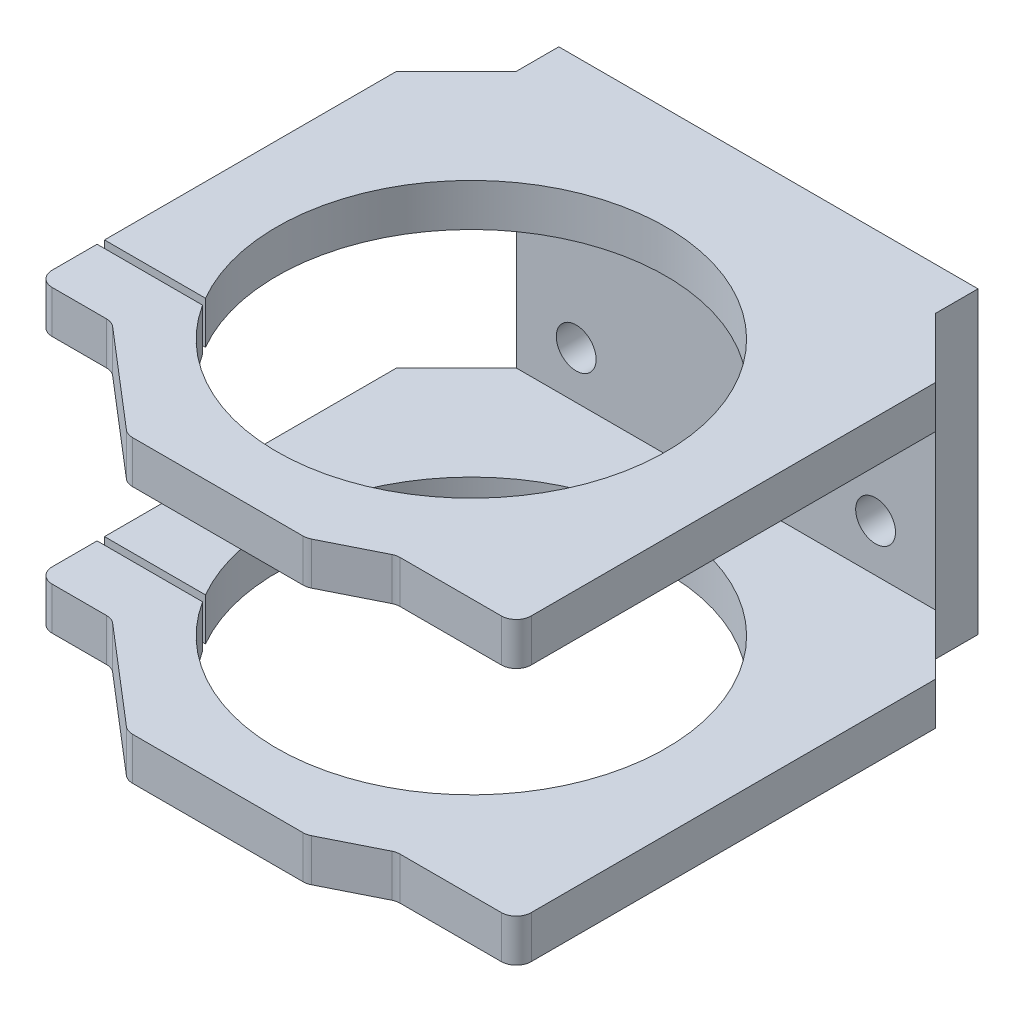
ISO-10303-21;
HEADER;
FILE_DESCRIPTION(('STEP AP214'),'2;1');
FILE_NAME('part.step','',(''),(''),'','','');
FILE_SCHEMA(('AUTOMOTIVE_DESIGN { 1 0 10303 214 1 1 1 1 }'));
ENDSEC;
DATA;
#1=APPLICATION_CONTEXT('core data for automotive mechanical design processes');
#2=APPLICATION_PROTOCOL_DEFINITION('international standard','automotive_design',2000,#1);
#3=PRODUCT_CONTEXT('',#1,'mechanical');
#4=PRODUCT('Part','Part','',(#3));
#5=PRODUCT_RELATED_PRODUCT_CATEGORY('part','',(#4));
#6=PRODUCT_DEFINITION_FORMATION('','',#4);
#7=PRODUCT_DEFINITION_CONTEXT('part definition',#1,'design');
#8=PRODUCT_DEFINITION('design','',#6,#7);
#9=PRODUCT_DEFINITION_SHAPE('','',#8);
#10=(LENGTH_UNIT() NAMED_UNIT(*) SI_UNIT(.MILLI.,.METRE.));
#11=(NAMED_UNIT(*) PLANE_ANGLE_UNIT() SI_UNIT($,.RADIAN.));
#12=(NAMED_UNIT(*) SI_UNIT($,.STERADIAN.) SOLID_ANGLE_UNIT());
#13=UNCERTAINTY_MEASURE_WITH_UNIT(LENGTH_MEASURE(1.E-05),#10,'distance_accuracy_value','');
#14=(GEOMETRIC_REPRESENTATION_CONTEXT(3) GLOBAL_UNCERTAINTY_ASSIGNED_CONTEXT((#13)) GLOBAL_UNIT_ASSIGNED_CONTEXT((#10,
#11,#12)) REPRESENTATION_CONTEXT('',''));
#15=CARTESIAN_POINT('',(0.,0.,0.));
#16=DIRECTION('',(0.,0.,1.));
#17=DIRECTION('',(1.,0.,0.));
#18=AXIS2_PLACEMENT_3D('',#15,#16,#17);
#19=CARTESIAN_POINT('',(-44.45,31.75,9.017));
#20=DIRECTION('',(0.,0.,-1.));
#21=DIRECTION('',(-1.,0.,0.));
#22=AXIS2_PLACEMENT_3D('',#19,#20,#21);
#23=PLANE('',#22);
#24=CARTESIAN_POINT('',(-31.75,12.7,9.017));
#25=DIRECTION('',(0.,0.,1.));
#26=DIRECTION('',(1.,0.,0.));
#27=AXIS2_PLACEMENT_3D('',#24,#25,#26);
#28=CIRCLE('',#27,4.22275);
#29=CARTESIAN_POINT('',(-27.52725,12.7,9.017));
#30=VERTEX_POINT('',#29);
#31=EDGE_CURVE('E622',#30,#30,#28,.T.);
#32=ORIENTED_EDGE('',*,*,#31,.F.);
#33=EDGE_LOOP('',(#32));
#34=FACE_BOUND('',#33,.T.);
#35=CARTESIAN_POINT('',(31.75,12.7,9.017));
#36=DIRECTION('',(0.,0.,1.));
#37=DIRECTION('',(-1.,0.,0.));
#38=AXIS2_PLACEMENT_3D('',#35,#36,#37);
#39=CIRCLE('',#38,4.22274999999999);
#40=CARTESIAN_POINT('',(27.52725,12.7,9.017));
#41=VERTEX_POINT('',#40);
#42=EDGE_CURVE('E616',#41,#41,#39,.T.);
#43=ORIENTED_EDGE('',*,*,#42,.F.);
#44=EDGE_LOOP('',(#43));
#45=FACE_BOUND('',#44,.T.);
#46=CARTESIAN_POINT('',(-31.75,-12.7,9.017));
#47=DIRECTION('',(0.,0.,1.));
#48=DIRECTION('',(-1.,0.,0.));
#49=AXIS2_PLACEMENT_3D('',#46,#47,#48);
#50=CIRCLE('',#49,4.22275);
#51=CARTESIAN_POINT('',(-35.97275,-12.7,9.017));
#52=VERTEX_POINT('',#51);
#53=EDGE_CURVE('E610',#52,#52,#50,.T.);
#54=ORIENTED_EDGE('',*,*,#53,.F.);
#55=EDGE_LOOP('',(#54));
#56=FACE_BOUND('',#55,.T.);
#57=CARTESIAN_POINT('',(31.75,-12.7,9.017));
#58=DIRECTION('',(0.,0.,1.));
#59=DIRECTION('',(1.,0.,0.));
#60=AXIS2_PLACEMENT_3D('',#57,#58,#59);
#61=CIRCLE('',#60,4.22274999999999);
#62=CARTESIAN_POINT('',(35.97275,-12.7,9.017));
#63=VERTEX_POINT('',#62);
#64=EDGE_CURVE('E603',#63,#63,#61,.T.);
#65=ORIENTED_EDGE('',*,*,#64,.F.);
#66=EDGE_LOOP('',(#65));
#67=FACE_BOUND('',#66,.T.);
#68=DIRECTION('',(-1.,0.,0.));
#69=VECTOR('',#68,1.);
#70=CARTESIAN_POINT('',(44.45,-22.733,9.017));
#71=LINE('',#70,#69);
#72=CARTESIAN_POINT('',(44.45,-22.733,9.017));
#73=VERTEX_POINT('',#72);
#74=CARTESIAN_POINT('',(-44.45,-22.733,9.017));
#75=VERTEX_POINT('',#74);
#76=EDGE_CURVE('E371',#73,#75,#71,.T.);
#77=ORIENTED_EDGE('',*,*,#76,.F.);
#78=DIRECTION('',(0.,1.,0.));
#79=VECTOR('',#78,1.);
#80=CARTESIAN_POINT('',(44.45,-31.75,9.017));
#81=LINE('',#80,#79);
#82=CARTESIAN_POINT('',(44.45,22.733,9.017));
#83=VERTEX_POINT('',#82);
#84=EDGE_CURVE('E521',#73,#83,#81,.T.);
#85=ORIENTED_EDGE('',*,*,#84,.T.);
#86=DIRECTION('',(-1.,0.,0.));
#87=VECTOR('',#86,1.);
#88=CARTESIAN_POINT('',(44.45,22.733,9.017));
#89=LINE('',#88,#87);
#90=CARTESIAN_POINT('',(-44.45,22.733,9.017));
#91=VERTEX_POINT('',#90);
#92=EDGE_CURVE('E443',#83,#91,#89,.T.);
#93=ORIENTED_EDGE('',*,*,#92,.T.);
#94=DIRECTION('',(0.,-1.,0.));
#95=VECTOR('',#94,1.);
#96=CARTESIAN_POINT('',(-44.45,-31.75,9.017));
#97=LINE('',#96,#95);
#98=EDGE_CURVE('E542',#91,#75,#97,.T.);
#99=ORIENTED_EDGE('',*,*,#98,.T.);
#100=EDGE_LOOP('',(#77,#85,#93,#99));
#101=FACE_BOUND('',#100,.T.);
#102=ADVANCED_FACE('F32',(#34,#45,#56,#67,#101),#23,.F.);
#103=CARTESIAN_POINT('',(-44.45,-31.75,9.017));
#104=DIRECTION('',(1.,0.,0.));
#105=DIRECTION('',(0.,1.,0.));
#106=AXIS2_PLACEMENT_3D('',#103,#104,#105);
#107=PLANE('',#106);
#108=DIRECTION('',(0.,-1.,0.));
#109=VECTOR('',#108,1.);
#110=CARTESIAN_POINT('',(-44.45,-31.75,0.));
#111=LINE('',#110,#109);
#112=CARTESIAN_POINT('',(-44.45,31.75,0.));
#113=VERTEX_POINT('',#112);
#114=CARTESIAN_POINT('',(-44.45,-31.75,0.));
#115=VERTEX_POINT('',#114);
#116=EDGE_CURVE('E628',#113,#115,#111,.T.);
#117=ORIENTED_EDGE('',*,*,#116,.T.);
#118=DIRECTION('',(0.,0.,-1.));
#119=VECTOR('',#118,1.);
#120=CARTESIAN_POINT('',(-44.45,-31.75,9.017));
#121=LINE('',#120,#119);
#122=CARTESIAN_POINT('',(-44.45,-31.75,9.017));
#123=VERTEX_POINT('',#122);
#124=EDGE_CURVE('E469',#123,#115,#121,.T.);
#125=ORIENTED_EDGE('',*,*,#124,.F.);
#126=DIRECTION('',(0.,-1.,0.));
#127=VECTOR('',#126,1.);
#128=CARTESIAN_POINT('',(-44.45,-22.733,9.017));
#129=LINE('',#128,#127);
#130=EDGE_CURVE('E382',#75,#123,#129,.T.);
#131=ORIENTED_EDGE('',*,*,#130,.F.);
#132=ORIENTED_EDGE('',*,*,#98,.F.);
#133=CARTESIAN_POINT('',(-44.45,31.75,9.017));
#134=VERTEX_POINT('',#133);
#135=EDGE_CURVE('E523',#134,#91,#97,.T.);
#136=ORIENTED_EDGE('',*,*,#135,.F.);
#137=DIRECTION('',(0.,0.,-1.));
#138=VECTOR('',#137,1.);
#139=CARTESIAN_POINT('',(-44.45,31.75,9.017));
#140=LINE('',#139,#138);
#141=EDGE_CURVE('E530',#134,#113,#140,.T.);
#142=ORIENTED_EDGE('',*,*,#141,.T.);
#143=EDGE_LOOP('',(#117,#125,#131,#132,#136,#142));
#144=FACE_BOUND('',#143,.T.);
#145=ADVANCED_FACE('F34',(#144),#107,.F.);
#146=CARTESIAN_POINT('',(-44.45,-31.75,9.017));
#147=DIRECTION('',(0.,1.,0.));
#148=DIRECTION('',(0.,0.,1.));
#149=AXIS2_PLACEMENT_3D('',#146,#147,#148);
#150=PLANE('',#149);
#151=DIRECTION('',(1.,0.,0.));
#152=VECTOR('',#151,1.);
#153=CARTESIAN_POINT('',(-57.15,-31.75,97.917));
#154=LINE('',#153,#152);
#155=CARTESIAN_POINT('',(-53.975,-31.75,97.917));
#156=VERTEX_POINT('',#155);
#157=CARTESIAN_POINT('',(-42.4495089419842,-31.75,97.917));
#158=VERTEX_POINT('',#157);
#159=EDGE_CURVE('E328',#156,#158,#154,.T.);
#160=ORIENTED_EDGE('',*,*,#159,.F.);
#161=CARTESIAN_POINT('',(-53.975,-31.75,94.742));
#162=DIRECTION('',(0.,1.,0.));
#163=DIRECTION('',(0.,0.,1.));
#164=AXIS2_PLACEMENT_3D('',#161,#162,#163);
#165=CIRCLE('',#164,3.175);
#166=CARTESIAN_POINT('',(-57.15,-31.75,94.742));
#167=VERTEX_POINT('',#166);
#168=EDGE_CURVE('E327',#156,#167,#165,.F.);
#169=ORIENTED_EDGE('',*,*,#168,.T.);
#170=DIRECTION('',(0.,0.,1.));
#171=VECTOR('',#170,1.);
#172=CARTESIAN_POINT('',(-57.15,-31.75,85.217));
#173=LINE('',#172,#171);
#174=CARTESIAN_POINT('',(-57.15,-31.75,85.217));
#175=VERTEX_POINT('',#174);
#176=EDGE_CURVE('E315',#175,#167,#173,.T.);
#177=ORIENTED_EDGE('',*,*,#176,.F.);
#178=DIRECTION('',(-1.,0.,0.));
#179=VECTOR('',#178,1.);
#180=CARTESIAN_POINT('',(-57.15,-31.75,85.217));
#181=LINE('',#180,#179);
#182=CARTESIAN_POINT('',(-34.7803824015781,-31.75,85.217));
#183=VERTEX_POINT('',#182);
#184=EDGE_CURVE('E303',#183,#175,#181,.T.);
#185=ORIENTED_EDGE('',*,*,#184,.F.);
#186=CARTESIAN_POINT('',(0.,-31.75,62.992));
#187=DIRECTION('',(0.,-1.,0.));
#188=DIRECTION('',(0.,0.,1.));
#189=AXIS2_PLACEMENT_3D('',#186,#187,#188);
#190=CIRCLE('',#189,41.275);
#191=CARTESIAN_POINT('',(-35.7378631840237,-31.75,83.6422));
#192=VERTEX_POINT('',#191);
#193=EDGE_CURVE('E314',#192,#183,#190,.T.);
#194=ORIENTED_EDGE('',*,*,#193,.F.);
#195=DIRECTION('',(1.,0.,0.));
#196=VECTOR('',#195,1.);
#197=CARTESIAN_POINT('',(-57.15,-31.75,83.6422));
#198=LINE('',#197,#196);
#199=CARTESIAN_POINT('',(-57.15,-31.75,83.6422));
#200=VERTEX_POINT('',#199);
#201=EDGE_CURVE('E336',#200,#192,#198,.T.);
#202=ORIENTED_EDGE('',*,*,#201,.F.);
#203=DIRECTION('',(0.,0.,1.));
#204=VECTOR('',#203,1.);
#205=CARTESIAN_POINT('',(-57.15,-31.75,21.7170000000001));
#206=LINE('',#205,#204);
#207=CARTESIAN_POINT('',(-57.15,-31.75,21.7170000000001));
#208=VERTEX_POINT('',#207);
#209=EDGE_CURVE('E338',#208,#200,#206,.T.);
#210=ORIENTED_EDGE('',*,*,#209,.F.);
#211=DIRECTION('',(-0.707106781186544,0.,0.707106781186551));
#212=VECTOR('',#211,1.);
#213=CARTESIAN_POINT('',(-44.45,-31.75,9.017));
#214=LINE('',#213,#212);
#215=EDGE_CURVE('E340',#123,#208,#214,.T.);
#216=ORIENTED_EDGE('',*,*,#215,.F.);
#217=ORIENTED_EDGE('',*,*,#124,.T.);
#218=DIRECTION('',(1.,0.,0.));
#219=VECTOR('',#218,1.);
#220=CARTESIAN_POINT('',(-44.45,-31.75,0.));
#221=LINE('',#220,#219);
#222=CARTESIAN_POINT('',(44.45,-31.75,0.));
#223=VERTEX_POINT('',#222);
#224=EDGE_CURVE('E630',#115,#223,#221,.T.);
#225=ORIENTED_EDGE('',*,*,#224,.T.);
#226=DIRECTION('',(0.,0.,-1.));
#227=VECTOR('',#226,1.);
#228=CARTESIAN_POINT('',(44.45,-31.75,9.017));
#229=LINE('',#228,#227);
#230=CARTESIAN_POINT('',(44.45,-31.75,9.017));
#231=VERTEX_POINT('',#230);
#232=EDGE_CURVE('E537',#231,#223,#229,.T.);
#233=ORIENTED_EDGE('',*,*,#232,.F.);
#234=DIRECTION('',(-0.707106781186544,0.,-0.707106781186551));
#235=VECTOR('',#234,1.);
#236=CARTESIAN_POINT('',(44.45,-31.75,9.017));
#237=LINE('',#236,#235);
#238=CARTESIAN_POINT('',(57.15,-31.75,21.7170000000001));
#239=VERTEX_POINT('',#238);
#240=EDGE_CURVE('E342',#239,#231,#237,.T.);
#241=ORIENTED_EDGE('',*,*,#240,.F.);
#242=DIRECTION('',(0.,0.,-1.));
#243=VECTOR('',#242,1.);
#244=CARTESIAN_POINT('',(57.15,-31.75,21.7170000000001));
#245=LINE('',#244,#243);
#246=CARTESIAN_POINT('',(57.15,-31.75,107.442));
#247=VERTEX_POINT('',#246);
#248=EDGE_CURVE('E345',#247,#239,#245,.T.);
#249=ORIENTED_EDGE('',*,*,#248,.F.);
#250=CARTESIAN_POINT('',(53.975,-31.75,107.442));
#251=DIRECTION('',(0.,1.,0.));
#252=DIRECTION('',(0.,0.,1.));
#253=AXIS2_PLACEMENT_3D('',#250,#251,#252);
#254=CIRCLE('',#253,3.175);
#255=CARTESIAN_POINT('',(53.975,-31.75,110.617));
#256=VERTEX_POINT('',#255);
#257=EDGE_CURVE('E649',#247,#256,#254,.F.);
#258=ORIENTED_EDGE('',*,*,#257,.T.);
#259=DIRECTION('',(1.,0.,0.));
#260=VECTOR('',#259,1.);
#261=CARTESIAN_POINT('',(57.15,-31.75,110.617));
#262=LINE('',#261,#260);
#263=CARTESIAN_POINT('',(32.4995158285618,-31.75,110.617));
#264=VERTEX_POINT('',#263);
#265=EDGE_CURVE('E651',#264,#256,#262,.T.);
#266=ORIENTED_EDGE('',*,*,#265,.F.);
#267=CARTESIAN_POINT('',(32.4995158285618,-31.75,113.792));
#268=DIRECTION('',(0.,1.,0.));
#269=DIRECTION('',(0.,0.,1.));
#270=AXIS2_PLACEMENT_3D('',#267,#268,#269);
#271=CIRCLE('',#270,3.175);
#272=CARTESIAN_POINT('',(31.0796126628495,-31.75,110.952193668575));
#273=VERTEX_POINT('',#272);
#274=EDGE_CURVE('E686',#264,#273,#271,.T.);
#275=ORIENTED_EDGE('',*,*,#274,.T.);
#276=DIRECTION('',(0.894427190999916,0.,-0.447213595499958));
#277=VECTOR('',#276,1.);
#278=CARTESIAN_POINT('',(31.75,-31.75,110.617));
#279=LINE('',#278,#277);
#280=CARTESIAN_POINT('',(19.7203873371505,-31.75,116.631806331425));
#281=VERTEX_POINT('',#280);
#282=EDGE_CURVE('E663',#281,#273,#279,.T.);
#283=ORIENTED_EDGE('',*,*,#282,.F.);
#284=CARTESIAN_POINT('',(18.3004841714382,-31.75,113.792));
#285=DIRECTION('',(0.,1.,0.));
#286=DIRECTION('',(0.,0.,1.));
#287=AXIS2_PLACEMENT_3D('',#284,#285,#286);
#288=CIRCLE('',#287,3.175);
#289=CARTESIAN_POINT('',(18.3004841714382,-31.75,116.967));
#290=VERTEX_POINT('',#289);
#291=EDGE_CURVE('E654',#281,#290,#288,.F.);
#292=ORIENTED_EDGE('',*,*,#291,.T.);
#293=DIRECTION('',(1.,0.,0.));
#294=VECTOR('',#293,1.);
#295=CARTESIAN_POINT('',(19.05,-31.75,116.967));
#296=LINE('',#295,#294);
#297=CARTESIAN_POINT('',(-17.8754910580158,-31.75,116.967));
#298=VERTEX_POINT('',#297);
#299=EDGE_CURVE('E1092',#298,#290,#296,.T.);
#300=ORIENTED_EDGE('',*,*,#299,.F.);
#301=CARTESIAN_POINT('',(-17.8754910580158,-31.75,113.792));
#302=DIRECTION('',(0.,1.,0.));
#303=DIRECTION('',(0.,0.,1.));
#304=AXIS2_PLACEMENT_3D('',#301,#302,#303);
#305=CIRCLE('',#304,3.175);
#306=CARTESIAN_POINT('',(-19.9417536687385,-31.75,116.20263971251));
#307=VERTEX_POINT('',#306);
#308=EDGE_CURVE('E702',#298,#307,#305,.F.);
#309=ORIENTED_EDGE('',*,*,#308,.T.);
#310=DIRECTION('',(0.759256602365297,0.,0.650791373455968));
#311=VECTOR('',#310,1.);
#312=CARTESIAN_POINT('',(-41.275,-31.75,97.917));
#313=LINE('',#312,#311);
#314=CARTESIAN_POINT('',(-40.3832463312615,-31.75,98.6813602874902));
#315=VERTEX_POINT('',#314);
#316=EDGE_CURVE('E331',#315,#307,#313,.T.);
#317=ORIENTED_EDGE('',*,*,#316,.F.);
#318=CARTESIAN_POINT('',(-42.4495089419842,-31.75,101.092));
#319=DIRECTION('',(0.,1.,0.));
#320=DIRECTION('',(0.,0.,1.));
#321=AXIS2_PLACEMENT_3D('',#318,#319,#320);
#322=CIRCLE('',#321,3.175);
#323=EDGE_CURVE('E40',#315,#158,#322,.T.);
#324=ORIENTED_EDGE('',*,*,#323,.T.);
#325=EDGE_LOOP('',(#160,#169,#177,#185,#194,#202,#210,#216,#217,#225,#233,#241,#249,#258,#266,
#275,#283,#292,#300,#309,#317,#324));
#326=FACE_BOUND('',#325,.T.);
#327=ADVANCED_FACE('F326',(#326),#150,.F.);
#328=CARTESIAN_POINT('',(44.45,-31.75,9.017));
#329=DIRECTION('',(-1.,0.,0.));
#330=DIRECTION('',(0.,-1.,0.));
#331=AXIS2_PLACEMENT_3D('',#328,#329,#330);
#332=PLANE('',#331);
#333=DIRECTION('',(0.,1.,0.));
#334=VECTOR('',#333,1.);
#335=CARTESIAN_POINT('',(44.45,-31.75,0.));
#336=LINE('',#335,#334);
#337=CARTESIAN_POINT('',(44.45,31.75,0.));
#338=VERTEX_POINT('',#337);
#339=EDGE_CURVE('E632',#223,#338,#336,.T.);
#340=ORIENTED_EDGE('',*,*,#339,.T.);
#341=DIRECTION('',(0.,0.,-1.));
#342=VECTOR('',#341,1.);
#343=CARTESIAN_POINT('',(44.45,31.75,9.017));
#344=LINE('',#343,#342);
#345=CARTESIAN_POINT('',(44.45,31.75,9.017));
#346=VERTEX_POINT('',#345);
#347=EDGE_CURVE('E534',#346,#338,#344,.T.);
#348=ORIENTED_EDGE('',*,*,#347,.F.);
#349=DIRECTION('',(0.,1.,0.));
#350=VECTOR('',#349,1.);
#351=CARTESIAN_POINT('',(44.45,22.733,9.017));
#352=LINE('',#351,#350);
#353=EDGE_CURVE('E455',#83,#346,#352,.T.);
#354=ORIENTED_EDGE('',*,*,#353,.F.);
#355=ORIENTED_EDGE('',*,*,#84,.F.);
#356=EDGE_CURVE('E448',#231,#73,#81,.T.);
#357=ORIENTED_EDGE('',*,*,#356,.F.);
#358=ORIENTED_EDGE('',*,*,#232,.T.);
#359=EDGE_LOOP('',(#340,#348,#354,#355,#357,#358));
#360=FACE_BOUND('',#359,.T.);
#361=ADVANCED_FACE('F579',(#360),#332,.F.);
#362=CARTESIAN_POINT('',(-44.45,31.75,9.017));
#363=DIRECTION('',(0.,-1.,0.));
#364=DIRECTION('',(0.,0.,-1.));
#365=AXIS2_PLACEMENT_3D('',#362,#363,#364);
#366=PLANE('',#365);
#367=DIRECTION('',(0.,0.,1.));
#368=VECTOR('',#367,1.);
#369=CARTESIAN_POINT('',(-57.15,31.75,85.217));
#370=LINE('',#369,#368);
#371=CARTESIAN_POINT('',(-57.15,31.75,85.217));
#372=VERTEX_POINT('',#371);
#373=CARTESIAN_POINT('',(-57.15,31.75,94.742));
#374=VERTEX_POINT('',#373);
#375=EDGE_CURVE('E417',#372,#374,#370,.T.);
#376=ORIENTED_EDGE('',*,*,#375,.T.);
#377=CARTESIAN_POINT('',(-53.975,31.75,94.742));
#378=DIRECTION('',(0.,-1.,0.));
#379=DIRECTION('',(0.,0.,-1.));
#380=AXIS2_PLACEMENT_3D('',#377,#378,#379);
#381=CIRCLE('',#380,3.175);
#382=CARTESIAN_POINT('',(-53.975,31.75,97.917));
#383=VERTEX_POINT('',#382);
#384=EDGE_CURVE('E475',#374,#383,#381,.F.);
#385=ORIENTED_EDGE('',*,*,#384,.T.);
#386=DIRECTION('',(1.,0.,0.));
#387=VECTOR('',#386,1.);
#388=CARTESIAN_POINT('',(-57.15,31.75,97.917));
#389=LINE('',#388,#387);
#390=CARTESIAN_POINT('',(-42.4495089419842,31.75,97.917));
#391=VERTEX_POINT('',#390);
#392=EDGE_CURVE('E420',#383,#391,#389,.T.);
#393=ORIENTED_EDGE('',*,*,#392,.T.);
#394=CARTESIAN_POINT('',(-42.4495089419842,31.75,101.092));
#395=DIRECTION('',(0.,-1.,0.));
#396=DIRECTION('',(0.,0.,-1.));
#397=AXIS2_PLACEMENT_3D('',#394,#395,#396);
#398=CIRCLE('',#397,3.175);
#399=CARTESIAN_POINT('',(-40.3832463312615,31.75,98.6813602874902));
#400=VERTEX_POINT('',#399);
#401=EDGE_CURVE('E516',#391,#400,#398,.T.);
#402=ORIENTED_EDGE('',*,*,#401,.T.);
#403=DIRECTION('',(0.759256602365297,0.,0.650791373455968));
#404=VECTOR('',#403,1.);
#405=CARTESIAN_POINT('',(-41.275,31.75,97.917));
#406=LINE('',#405,#404);
#407=CARTESIAN_POINT('',(-19.9417536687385,31.75,116.20263971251));
#408=VERTEX_POINT('',#407);
#409=EDGE_CURVE('E423',#400,#408,#406,.T.);
#410=ORIENTED_EDGE('',*,*,#409,.T.);
#411=CARTESIAN_POINT('',(-17.8754910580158,31.75,113.792));
#412=DIRECTION('',(0.,-1.,0.));
#413=DIRECTION('',(0.,0.,-1.));
#414=AXIS2_PLACEMENT_3D('',#411,#412,#413);
#415=CIRCLE('',#414,3.175);
#416=CARTESIAN_POINT('',(-17.8754910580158,31.75,116.967));
#417=VERTEX_POINT('',#416);
#418=EDGE_CURVE('E468',#408,#417,#415,.F.);
#419=ORIENTED_EDGE('',*,*,#418,.T.);
#420=DIRECTION('',(1.,0.,0.));
#421=VECTOR('',#420,1.);
#422=CARTESIAN_POINT('',(19.05,31.75,116.967));
#423=LINE('',#422,#421);
#424=CARTESIAN_POINT('',(18.3004841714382,31.75,116.967));
#425=VERTEX_POINT('',#424);
#426=EDGE_CURVE('E426',#417,#425,#423,.T.);
#427=ORIENTED_EDGE('',*,*,#426,.T.);
#428=CARTESIAN_POINT('',(18.3004841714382,31.75,113.792));
#429=DIRECTION('',(0.,-1.,0.));
#430=DIRECTION('',(0.,0.,-1.));
#431=AXIS2_PLACEMENT_3D('',#428,#429,#430);
#432=CIRCLE('',#431,3.175);
#433=CARTESIAN_POINT('',(19.7203873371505,31.75,116.631806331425));
#434=VERTEX_POINT('',#433);
#435=EDGE_CURVE('E471',#425,#434,#432,.F.);
#436=ORIENTED_EDGE('',*,*,#435,.T.);
#437=DIRECTION('',(0.894427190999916,0.,-0.447213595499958));
#438=VECTOR('',#437,1.);
#439=CARTESIAN_POINT('',(31.75,31.75,110.617));
#440=LINE('',#439,#438);
#441=CARTESIAN_POINT('',(31.0796126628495,31.75,110.952193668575));
#442=VERTEX_POINT('',#441);
#443=EDGE_CURVE('E429',#434,#442,#440,.T.);
#444=ORIENTED_EDGE('',*,*,#443,.T.);
#445=CARTESIAN_POINT('',(32.4995158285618,31.75,113.792));
#446=DIRECTION('',(0.,-1.,0.));
#447=DIRECTION('',(0.,0.,-1.));
#448=AXIS2_PLACEMENT_3D('',#445,#446,#447);
#449=CIRCLE('',#448,3.175);
#450=CARTESIAN_POINT('',(32.4995158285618,31.75,110.617));
#451=VERTEX_POINT('',#450);
#452=EDGE_CURVE('E512',#442,#451,#449,.T.);
#453=ORIENTED_EDGE('',*,*,#452,.T.);
#454=DIRECTION('',(1.,0.,0.));
#455=VECTOR('',#454,1.);
#456=CARTESIAN_POINT('',(57.15,31.75,110.617));
#457=LINE('',#456,#455);
#458=CARTESIAN_POINT('',(53.975,31.75,110.617));
#459=VERTEX_POINT('',#458);
#460=EDGE_CURVE('E381',#451,#459,#457,.T.);
#461=ORIENTED_EDGE('',*,*,#460,.T.);
#462=CARTESIAN_POINT('',(53.975,31.75,107.442));
#463=DIRECTION('',(0.,-1.,0.));
#464=DIRECTION('',(0.,0.,-1.));
#465=AXIS2_PLACEMENT_3D('',#462,#463,#464);
#466=CIRCLE('',#465,3.175);
#467=CARTESIAN_POINT('',(57.15,31.75,107.442));
#468=VERTEX_POINT('',#467);
#469=EDGE_CURVE('E473',#459,#468,#466,.F.);
#470=ORIENTED_EDGE('',*,*,#469,.T.);
#471=DIRECTION('',(0.,0.,-1.));
#472=VECTOR('',#471,1.);
#473=CARTESIAN_POINT('',(57.15,31.75,21.7170000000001));
#474=LINE('',#473,#472);
#475=CARTESIAN_POINT('',(57.15,31.75,21.7170000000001));
#476=VERTEX_POINT('',#475);
#477=EDGE_CURVE('E397',#468,#476,#474,.T.);
#478=ORIENTED_EDGE('',*,*,#477,.T.);
#479=DIRECTION('',(-0.707106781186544,0.,-0.707106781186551));
#480=VECTOR('',#479,1.);
#481=CARTESIAN_POINT('',(44.45,31.75,9.017));
#482=LINE('',#481,#480);
#483=EDGE_CURVE('E399',#476,#346,#482,.T.);
#484=ORIENTED_EDGE('',*,*,#483,.T.);
#485=ORIENTED_EDGE('',*,*,#347,.T.);
#486=DIRECTION('',(-1.,0.,0.));
#487=VECTOR('',#486,1.);
#488=CARTESIAN_POINT('',(-44.45,31.75,0.));
#489=LINE('',#488,#487);
#490=EDGE_CURVE('E544',#338,#113,#489,.T.);
#491=ORIENTED_EDGE('',*,*,#490,.T.);
#492=ORIENTED_EDGE('',*,*,#141,.F.);
#493=DIRECTION('',(-0.707106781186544,0.,0.707106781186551));
#494=VECTOR('',#493,1.);
#495=CARTESIAN_POINT('',(-44.45,31.75,9.017));
#496=LINE('',#495,#494);
#497=CARTESIAN_POINT('',(-57.15,31.75,21.7170000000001));
#498=VERTEX_POINT('',#497);
#499=EDGE_CURVE('E402',#134,#498,#496,.T.);
#500=ORIENTED_EDGE('',*,*,#499,.T.);
#501=DIRECTION('',(0.,0.,1.));
#502=VECTOR('',#501,1.);
#503=CARTESIAN_POINT('',(-57.15,31.75,21.7170000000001));
#504=LINE('',#503,#502);
#505=CARTESIAN_POINT('',(-57.15,31.75,83.6422));
#506=VERTEX_POINT('',#505);
#507=EDGE_CURVE('E405',#498,#506,#504,.T.);
#508=ORIENTED_EDGE('',*,*,#507,.T.);
#509=DIRECTION('',(1.,0.,0.));
#510=VECTOR('',#509,1.);
#511=CARTESIAN_POINT('',(-57.15,31.75,83.6422));
#512=LINE('',#511,#510);
#513=CARTESIAN_POINT('',(-35.7378631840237,31.75,83.6422));
#514=VERTEX_POINT('',#513);
#515=EDGE_CURVE('E408',#506,#514,#512,.T.);
#516=ORIENTED_EDGE('',*,*,#515,.T.);
#517=CARTESIAN_POINT('',(0.,31.75,62.992));
#518=DIRECTION('',(0.,-1.,0.));
#519=DIRECTION('',(0.,0.,1.));
#520=AXIS2_PLACEMENT_3D('',#517,#518,#519);
#521=CIRCLE('',#520,41.275);
#522=CARTESIAN_POINT('',(-34.7803824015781,31.75,85.217));
#523=VERTEX_POINT('',#522);
#524=EDGE_CURVE('E411',#514,#523,#521,.T.);
#525=ORIENTED_EDGE('',*,*,#524,.T.);
#526=DIRECTION('',(-1.,0.,0.));
#527=VECTOR('',#526,1.);
#528=CARTESIAN_POINT('',(-57.15,31.75,85.217));
#529=LINE('',#528,#527);
#530=EDGE_CURVE('E414',#523,#372,#529,.T.);
#531=ORIENTED_EDGE('',*,*,#530,.T.);
#532=EDGE_LOOP('',(#376,#385,#393,#402,#410,#419,#427,#436,#444,#453,#461,#470,#478,#484,#485,
#491,#492,#500,#508,#516,#525,#531));
#533=FACE_BOUND('',#532,.T.);
#534=ADVANCED_FACE('F587',(#533),#366,.F.);
#535=CARTESIAN_POINT('',(-44.45,31.75,0.));
#536=DIRECTION('',(0.,0.,-1.));
#537=DIRECTION('',(-1.,0.,0.));
#538=AXIS2_PLACEMENT_3D('',#535,#536,#537);
#539=PLANE('',#538);
#540=CARTESIAN_POINT('',(31.75,-12.7,0.));
#541=DIRECTION('',(0.,0.,1.));
#542=DIRECTION('',(1.,0.,0.));
#543=AXIS2_PLACEMENT_3D('',#540,#541,#542);
#544=CIRCLE('',#543,4.22274999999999);
#545=CARTESIAN_POINT('',(35.97275,-12.7,0.));
#546=VERTEX_POINT('',#545);
#547=EDGE_CURVE('E606',#546,#546,#544,.T.);
#548=ORIENTED_EDGE('',*,*,#547,.T.);
#549=EDGE_LOOP('',(#548));
#550=FACE_BOUND('',#549,.T.);
#551=CARTESIAN_POINT('',(-31.75,-12.7,0.));
#552=DIRECTION('',(0.,0.,1.));
#553=DIRECTION('',(-1.,0.,0.));
#554=AXIS2_PLACEMENT_3D('',#551,#552,#553);
#555=CIRCLE('',#554,4.22275);
#556=CARTESIAN_POINT('',(-35.97275,-12.7,0.));
#557=VERTEX_POINT('',#556);
#558=EDGE_CURVE('E613',#557,#557,#555,.T.);
#559=ORIENTED_EDGE('',*,*,#558,.T.);
#560=EDGE_LOOP('',(#559));
#561=FACE_BOUND('',#560,.T.);
#562=CARTESIAN_POINT('',(31.75,12.7,0.));
#563=DIRECTION('',(0.,0.,1.));
#564=DIRECTION('',(-1.,0.,0.));
#565=AXIS2_PLACEMENT_3D('',#562,#563,#564);
#566=CIRCLE('',#565,4.22274999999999);
#567=CARTESIAN_POINT('',(27.52725,12.7,0.));
#568=VERTEX_POINT('',#567);
#569=EDGE_CURVE('E619',#568,#568,#566,.T.);
#570=ORIENTED_EDGE('',*,*,#569,.T.);
#571=EDGE_LOOP('',(#570));
#572=FACE_BOUND('',#571,.T.);
#573=CARTESIAN_POINT('',(-31.75,12.7,0.));
#574=DIRECTION('',(0.,0.,1.));
#575=DIRECTION('',(1.,0.,0.));
#576=AXIS2_PLACEMENT_3D('',#573,#574,#575);
#577=CIRCLE('',#576,4.22275);
#578=CARTESIAN_POINT('',(-27.52725,12.7,0.));
#579=VERTEX_POINT('',#578);
#580=EDGE_CURVE('E625',#579,#579,#577,.T.);
#581=ORIENTED_EDGE('',*,*,#580,.T.);
#582=EDGE_LOOP('',(#581));
#583=FACE_BOUND('',#582,.T.);
#584=ORIENTED_EDGE('',*,*,#116,.F.);
#585=ORIENTED_EDGE('',*,*,#490,.F.);
#586=ORIENTED_EDGE('',*,*,#339,.F.);
#587=ORIENTED_EDGE('',*,*,#224,.F.);
#588=EDGE_LOOP('',(#584,#585,#586,#587));
#589=FACE_BOUND('',#588,.T.);
#590=ADVANCED_FACE('F636',(#550,#561,#572,#583,#589),#539,.T.);
#591=CARTESIAN_POINT('',(-31.75,12.7,0.));
#592=DIRECTION('',(0.,0.,1.));
#593=DIRECTION('',(1.,0.,0.));
#594=AXIS2_PLACEMENT_3D('',#591,#592,#593);
#595=CYLINDRICAL_SURFACE('',#594,4.22275);
#596=ORIENTED_EDGE('',*,*,#580,.F.);
#597=EDGE_LOOP('',(#596));
#598=FACE_BOUND('',#597,.T.);
#599=ORIENTED_EDGE('',*,*,#31,.T.);
#600=EDGE_LOOP('',(#599));
#601=FACE_BOUND('',#600,.T.);
#602=ADVANCED_FACE('F763',(#598,#601),#595,.F.);
#603=CARTESIAN_POINT('',(31.75,12.7,0.));
#604=DIRECTION('',(0.,0.,1.));
#605=DIRECTION('',(1.,0.,0.));
#606=AXIS2_PLACEMENT_3D('',#603,#604,#605);
#607=CYLINDRICAL_SURFACE('',#606,4.22274999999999);
#608=ORIENTED_EDGE('',*,*,#569,.F.);
#609=EDGE_LOOP('',(#608));
#610=FACE_BOUND('',#609,.T.);
#611=ORIENTED_EDGE('',*,*,#42,.T.);
#612=EDGE_LOOP('',(#611));
#613=FACE_BOUND('',#612,.T.);
#614=ADVANCED_FACE('F770',(#610,#613),#607,.F.);
#615=CARTESIAN_POINT('',(-31.75,-12.7,0.));
#616=DIRECTION('',(0.,0.,1.));
#617=DIRECTION('',(1.,0.,0.));
#618=AXIS2_PLACEMENT_3D('',#615,#616,#617);
#619=CYLINDRICAL_SURFACE('',#618,4.22275);
#620=ORIENTED_EDGE('',*,*,#558,.F.);
#621=EDGE_LOOP('',(#620));
#622=FACE_BOUND('',#621,.T.);
#623=ORIENTED_EDGE('',*,*,#53,.T.);
#624=EDGE_LOOP('',(#623));
#625=FACE_BOUND('',#624,.T.);
#626=ADVANCED_FACE('F777',(#622,#625),#619,.F.);
#627=CARTESIAN_POINT('',(31.75,-12.7,0.));
#628=DIRECTION('',(0.,0.,1.));
#629=DIRECTION('',(1.,0.,0.));
#630=AXIS2_PLACEMENT_3D('',#627,#628,#629);
#631=CYLINDRICAL_SURFACE('',#630,4.22274999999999);
#632=ORIENTED_EDGE('',*,*,#547,.F.);
#633=EDGE_LOOP('',(#632));
#634=FACE_BOUND('',#633,.T.);
#635=ORIENTED_EDGE('',*,*,#64,.T.);
#636=EDGE_LOOP('',(#635));
#637=FACE_BOUND('',#636,.T.);
#638=ADVANCED_FACE('F785',(#634,#637),#631,.F.);
#639=CARTESIAN_POINT('',(57.15,22.733,110.617));
#640=DIRECTION('',(0.,0.,1.));
#641=DIRECTION('',(1.,0.,0.));
#642=AXIS2_PLACEMENT_3D('',#639,#640,#641);
#643=PLANE('',#642);
#644=DIRECTION('',(1.,0.,0.));
#645=VECTOR('',#644,1.);
#646=CARTESIAN_POINT('',(57.15,22.733,110.617));
#647=LINE('',#646,#645);
#648=CARTESIAN_POINT('',(32.4995158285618,22.733,110.617));
#649=VERTEX_POINT('',#648);
#650=CARTESIAN_POINT('',(53.975,22.733,110.617));
#651=VERTEX_POINT('',#650);
#652=EDGE_CURVE('E432',#649,#651,#647,.T.);
#653=ORIENTED_EDGE('',*,*,#652,.T.);
#654=DIRECTION('',(0.,1.,0.));
#655=VECTOR('',#654,1.);
#656=CARTESIAN_POINT('',(53.975,22.733,110.617));
#657=LINE('',#656,#655);
#658=EDGE_CURVE('E492',#651,#459,#657,.T.);
#659=ORIENTED_EDGE('',*,*,#658,.T.);
#660=ORIENTED_EDGE('',*,*,#460,.F.);
#661=DIRECTION('',(0.,1.,0.));
#662=VECTOR('',#661,1.);
#663=CARTESIAN_POINT('',(32.4995158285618,22.733,110.617));
#664=LINE('',#663,#662);
#665=EDGE_CURVE('E490',#451,#649,#664,.F.);
#666=ORIENTED_EDGE('',*,*,#665,.T.);
#667=EDGE_LOOP('',(#653,#659,#660,#666));
#668=FACE_BOUND('',#667,.T.);
#669=ADVANCED_FACE('F793',(#668),#643,.T.);
#670=CARTESIAN_POINT('',(31.75,22.733,110.617));
#671=DIRECTION('',(0.447213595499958,0.,0.894427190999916));
#672=DIRECTION('',(0.894427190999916,0.,-0.447213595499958));
#673=AXIS2_PLACEMENT_3D('',#670,#671,#672);
#674=PLANE('',#673);
#675=DIRECTION('',(0.894427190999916,0.,-0.447213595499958));
#676=VECTOR('',#675,1.);
#677=CARTESIAN_POINT('',(31.75,22.733,110.617));
#678=LINE('',#677,#676);
#679=CARTESIAN_POINT('',(19.7203873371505,22.733,116.631806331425));
#680=VERTEX_POINT('',#679);
#681=CARTESIAN_POINT('',(31.0796126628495,22.733,110.952193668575));
#682=VERTEX_POINT('',#681);
#683=EDGE_CURVE('E595',#680,#682,#678,.T.);
#684=ORIENTED_EDGE('',*,*,#683,.T.);
#685=DIRECTION('',(0.,1.,0.));
#686=VECTOR('',#685,1.);
#687=CARTESIAN_POINT('',(31.0796126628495,31.75,110.952193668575));
#688=LINE('',#687,#686);
#689=EDGE_CURVE('E499',#682,#442,#688,.T.);
#690=ORIENTED_EDGE('',*,*,#689,.T.);
#691=ORIENTED_EDGE('',*,*,#443,.F.);
#692=DIRECTION('',(0.,1.,0.));
#693=VECTOR('',#692,1.);
#694=CARTESIAN_POINT('',(19.7203873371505,22.733,116.631806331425));
#695=LINE('',#694,#693);
#696=EDGE_CURVE('E497',#434,#680,#695,.F.);
#697=ORIENTED_EDGE('',*,*,#696,.T.);
#698=EDGE_LOOP('',(#684,#690,#691,#697));
#699=FACE_BOUND('',#698,.T.);
#700=ADVANCED_FACE('F801',(#699),#674,.T.);
#701=CARTESIAN_POINT('',(19.05,22.733,116.967));
#702=DIRECTION('',(0.,0.,1.));
#703=DIRECTION('',(1.,0.,0.));
#704=AXIS2_PLACEMENT_3D('',#701,#702,#703);
#705=PLANE('',#704);
#706=DIRECTION('',(1.,0.,0.));
#707=VECTOR('',#706,1.);
#708=CARTESIAN_POINT('',(19.05,22.733,116.967));
#709=LINE('',#708,#707);
#710=CARTESIAN_POINT('',(-17.8754910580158,22.733,116.967));
#711=VERTEX_POINT('',#710);
#712=CARTESIAN_POINT('',(18.3004841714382,22.733,116.967));
#713=VERTEX_POINT('',#712);
#714=EDGE_CURVE('E598',#711,#713,#709,.T.);
#715=ORIENTED_EDGE('',*,*,#714,.T.);
#716=DIRECTION('',(0.,1.,0.));
#717=VECTOR('',#716,1.);
#718=CARTESIAN_POINT('',(18.3004841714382,22.733,116.967));
#719=LINE('',#718,#717);
#720=EDGE_CURVE('E504',#713,#425,#719,.T.);
#721=ORIENTED_EDGE('',*,*,#720,.T.);
#722=ORIENTED_EDGE('',*,*,#426,.F.);
#723=DIRECTION('',(0.,1.,0.));
#724=VECTOR('',#723,1.);
#725=CARTESIAN_POINT('',(-17.8754910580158,22.733,116.967));
#726=LINE('',#725,#724);
#727=EDGE_CURVE('E502',#417,#711,#726,.F.);
#728=ORIENTED_EDGE('',*,*,#727,.T.);
#729=EDGE_LOOP('',(#715,#721,#722,#728));
#730=FACE_BOUND('',#729,.T.);
#731=ADVANCED_FACE('F809',(#730),#705,.T.);
#732=CARTESIAN_POINT('',(-41.275,22.733,97.917));
#733=DIRECTION('',(-0.650791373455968,0.,0.759256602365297));
#734=DIRECTION('',(0.759256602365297,0.,0.650791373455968));
#735=AXIS2_PLACEMENT_3D('',#732,#733,#734);
#736=PLANE('',#735);
#737=DIRECTION('',(0.759256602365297,0.,0.650791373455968));
#738=VECTOR('',#737,1.);
#739=CARTESIAN_POINT('',(-41.275,22.733,97.917));
#740=LINE('',#739,#738);
#741=CARTESIAN_POINT('',(-40.3832463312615,22.733,98.6813602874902));
#742=VERTEX_POINT('',#741);
#743=CARTESIAN_POINT('',(-19.9417536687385,22.733,116.20263971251));
#744=VERTEX_POINT('',#743);
#745=EDGE_CURVE('E1214',#742,#744,#740,.T.);
#746=ORIENTED_EDGE('',*,*,#745,.T.);
#747=DIRECTION('',(0.,1.,0.));
#748=VECTOR('',#747,1.);
#749=CARTESIAN_POINT('',(-19.9417536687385,22.733,116.20263971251));
#750=LINE('',#749,#748);
#751=EDGE_CURVE('E509',#744,#408,#750,.T.);
#752=ORIENTED_EDGE('',*,*,#751,.T.);
#753=ORIENTED_EDGE('',*,*,#409,.F.);
#754=DIRECTION('',(0.,1.,0.));
#755=VECTOR('',#754,1.);
#756=CARTESIAN_POINT('',(-40.3832463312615,22.733,98.6813602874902));
#757=LINE('',#756,#755);
#758=EDGE_CURVE('E507',#400,#742,#757,.F.);
#759=ORIENTED_EDGE('',*,*,#758,.T.);
#760=EDGE_LOOP('',(#746,#752,#753,#759));
#761=FACE_BOUND('',#760,.T.);
#762=ADVANCED_FACE('F817',(#761),#736,.T.);
#763=CARTESIAN_POINT('',(-57.15,22.733,97.917));
#764=DIRECTION('',(0.,0.,1.));
#765=DIRECTION('',(1.,0.,0.));
#766=AXIS2_PLACEMENT_3D('',#763,#764,#765);
#767=PLANE('',#766);
#768=ORIENTED_EDGE('',*,*,#392,.F.);
#769=DIRECTION('',(0.,1.,0.));
#770=VECTOR('',#769,1.);
#771=CARTESIAN_POINT('',(-53.975,22.733,97.917));
#772=LINE('',#771,#770);
#773=CARTESIAN_POINT('',(-53.975,22.733,97.917));
#774=VERTEX_POINT('',#773);
#775=EDGE_CURVE('E480',#383,#774,#772,.F.);
#776=ORIENTED_EDGE('',*,*,#775,.T.);
#777=DIRECTION('',(1.,0.,0.));
#778=VECTOR('',#777,1.);
#779=CARTESIAN_POINT('',(-57.15,22.733,97.917));
#780=LINE('',#779,#778);
#781=CARTESIAN_POINT('',(-42.4495089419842,22.733,97.917));
#782=VERTEX_POINT('',#781);
#783=EDGE_CURVE('E1211',#774,#782,#780,.T.);
#784=ORIENTED_EDGE('',*,*,#783,.T.);
#785=DIRECTION('',(0.,1.,0.));
#786=VECTOR('',#785,1.);
#787=CARTESIAN_POINT('',(-42.4495089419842,31.75,97.917));
#788=LINE('',#787,#786);
#789=EDGE_CURVE('E477',#782,#391,#788,.T.);
#790=ORIENTED_EDGE('',*,*,#789,.T.);
#791=EDGE_LOOP('',(#768,#776,#784,#790));
#792=FACE_BOUND('',#791,.T.);
#793=ADVANCED_FACE('F825',(#792),#767,.T.);
#794=CARTESIAN_POINT('',(-57.15,22.733,85.217));
#795=DIRECTION('',(-1.,0.,0.));
#796=DIRECTION('',(0.,0.,1.));
#797=AXIS2_PLACEMENT_3D('',#794,#795,#796);
#798=PLANE('',#797);
#799=DIRECTION('',(0.,0.,1.));
#800=VECTOR('',#799,1.);
#801=CARTESIAN_POINT('',(-57.15,22.733,85.217));
#802=LINE('',#801,#800);
#803=CARTESIAN_POINT('',(-57.15,22.733,85.217));
#804=VERTEX_POINT('',#803);
#805=CARTESIAN_POINT('',(-57.15,22.733,94.742));
#806=VERTEX_POINT('',#805);
#807=EDGE_CURVE('E1217',#804,#806,#802,.T.);
#808=ORIENTED_EDGE('',*,*,#807,.T.);
#809=DIRECTION('',(0.,1.,0.));
#810=VECTOR('',#809,1.);
#811=CARTESIAN_POINT('',(-57.15,22.733,94.742));
#812=LINE('',#811,#810);
#813=EDGE_CURVE('E465',#806,#374,#812,.T.);
#814=ORIENTED_EDGE('',*,*,#813,.T.);
#815=ORIENTED_EDGE('',*,*,#375,.F.);
#816=DIRECTION('',(0.,1.,0.));
#817=VECTOR('',#816,1.);
#818=CARTESIAN_POINT('',(-57.15,22.733,85.217));
#819=LINE('',#818,#817);
#820=EDGE_CURVE('E607',#804,#372,#819,.T.);
#821=ORIENTED_EDGE('',*,*,#820,.F.);
#822=EDGE_LOOP('',(#808,#814,#815,#821));
#823=FACE_BOUND('',#822,.T.);
#824=ADVANCED_FACE('F833',(#823),#798,.T.);
#825=CARTESIAN_POINT('',(-57.15,22.733,85.217));
#826=DIRECTION('',(0.,0.,-1.));
#827=DIRECTION('',(-1.,0.,0.));
#828=AXIS2_PLACEMENT_3D('',#825,#826,#827);
#829=PLANE('',#828);
#830=ORIENTED_EDGE('',*,*,#530,.F.);
#831=DIRECTION('',(0.,1.,0.));
#832=VECTOR('',#831,1.);
#833=CARTESIAN_POINT('',(-34.7803824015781,22.733,85.217));
#834=LINE('',#833,#832);
#835=CARTESIAN_POINT('',(-34.7803824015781,22.733,85.217));
#836=VERTEX_POINT('',#835);
#837=EDGE_CURVE('E1228',#836,#523,#834,.T.);
#838=ORIENTED_EDGE('',*,*,#837,.F.);
#839=DIRECTION('',(-1.,0.,0.));
#840=VECTOR('',#839,1.);
#841=CARTESIAN_POINT('',(-57.15,22.733,85.217));
#842=LINE('',#841,#840);
#843=EDGE_CURVE('E1221',#836,#804,#842,.T.);
#844=ORIENTED_EDGE('',*,*,#843,.T.);
#845=ORIENTED_EDGE('',*,*,#820,.T.);
#846=EDGE_LOOP('',(#830,#838,#844,#845));
#847=FACE_BOUND('',#846,.T.);
#848=ADVANCED_FACE('F841',(#847),#829,.T.);
#849=CARTESIAN_POINT('',(0.,22.733,62.992));
#850=DIRECTION('',(0.,1.,0.));
#851=DIRECTION('',(0.,0.,1.));
#852=AXIS2_PLACEMENT_3D('',#849,#850,#851);
#853=CYLINDRICAL_SURFACE('',#852,41.275);
#854=ORIENTED_EDGE('',*,*,#524,.F.);
#855=DIRECTION('',(0.,1.,0.));
#856=VECTOR('',#855,1.);
#857=CARTESIAN_POINT('',(-35.7378631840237,22.733,83.6422));
#858=LINE('',#857,#856);
#859=CARTESIAN_POINT('',(-35.7378631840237,22.733,83.6422));
#860=VERTEX_POINT('',#859);
#861=EDGE_CURVE('E1230',#860,#514,#858,.T.);
#862=ORIENTED_EDGE('',*,*,#861,.F.);
#863=CARTESIAN_POINT('',(0.,22.733,62.992));
#864=DIRECTION('',(0.,-1.,0.));
#865=DIRECTION('',(0.,0.,1.));
#866=AXIS2_PLACEMENT_3D('',#863,#864,#865);
#867=CIRCLE('',#866,41.275);
#868=EDGE_CURVE('E1243',#860,#836,#867,.T.);
#869=ORIENTED_EDGE('',*,*,#868,.T.);
#870=ORIENTED_EDGE('',*,*,#837,.T.);
#871=EDGE_LOOP('',(#854,#862,#869,#870));
#872=FACE_BOUND('',#871,.T.);
#873=ADVANCED_FACE('F849',(#872),#853,.F.);
#874=CARTESIAN_POINT('',(-57.15,22.733,83.6422));
#875=DIRECTION('',(0.,0.,1.));
#876=DIRECTION('',(1.,0.,0.));
#877=AXIS2_PLACEMENT_3D('',#874,#875,#876);
#878=PLANE('',#877);
#879=ORIENTED_EDGE('',*,*,#515,.F.);
#880=DIRECTION('',(0.,1.,0.));
#881=VECTOR('',#880,1.);
#882=CARTESIAN_POINT('',(-57.15,22.733,83.6422));
#883=LINE('',#882,#881);
#884=CARTESIAN_POINT('',(-57.15,22.733,83.6422));
#885=VERTEX_POINT('',#884);
#886=EDGE_CURVE('E1231',#885,#506,#883,.T.);
#887=ORIENTED_EDGE('',*,*,#886,.F.);
#888=DIRECTION('',(1.,0.,0.));
#889=VECTOR('',#888,1.);
#890=CARTESIAN_POINT('',(-57.15,22.733,83.6422));
#891=LINE('',#890,#889);
#892=EDGE_CURVE('E1239',#885,#860,#891,.T.);
#893=ORIENTED_EDGE('',*,*,#892,.T.);
#894=ORIENTED_EDGE('',*,*,#861,.T.);
#895=EDGE_LOOP('',(#879,#887,#893,#894));
#896=FACE_BOUND('',#895,.T.);
#897=ADVANCED_FACE('F857',(#896),#878,.T.);
#898=CARTESIAN_POINT('',(-57.15,22.733,21.7170000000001));
#899=DIRECTION('',(-1.,0.,0.));
#900=DIRECTION('',(0.,0.,1.));
#901=AXIS2_PLACEMENT_3D('',#898,#899,#900);
#902=PLANE('',#901);
#903=ORIENTED_EDGE('',*,*,#507,.F.);
#904=DIRECTION('',(0.,1.,0.));
#905=VECTOR('',#904,1.);
#906=CARTESIAN_POINT('',(-57.15,22.733,21.7170000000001));
#907=LINE('',#906,#905);
#908=CARTESIAN_POINT('',(-57.15,22.733,21.7170000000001));
#909=VERTEX_POINT('',#908);
#910=EDGE_CURVE('E457',#909,#498,#907,.T.);
#911=ORIENTED_EDGE('',*,*,#910,.F.);
#912=DIRECTION('',(0.,0.,1.));
#913=VECTOR('',#912,1.);
#914=CARTESIAN_POINT('',(-57.15,22.733,21.7170000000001));
#915=LINE('',#914,#913);
#916=EDGE_CURVE('E440',#909,#885,#915,.T.);
#917=ORIENTED_EDGE('',*,*,#916,.T.);
#918=ORIENTED_EDGE('',*,*,#886,.T.);
#919=EDGE_LOOP('',(#903,#911,#917,#918));
#920=FACE_BOUND('',#919,.T.);
#921=ADVANCED_FACE('F865',(#920),#902,.T.);
#922=CARTESIAN_POINT('',(-44.45,22.733,9.017));
#923=DIRECTION('',(-0.707106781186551,0.,-0.707106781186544));
#924=DIRECTION('',(-0.707106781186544,0.,0.707106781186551));
#925=AXIS2_PLACEMENT_3D('',#922,#923,#924);
#926=PLANE('',#925);
#927=ORIENTED_EDGE('',*,*,#499,.F.);
#928=ORIENTED_EDGE('',*,*,#135,.T.);
#929=DIRECTION('',(-0.707106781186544,0.,0.707106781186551));
#930=VECTOR('',#929,1.);
#931=CARTESIAN_POINT('',(-44.45,22.733,9.017));
#932=LINE('',#931,#930);
#933=EDGE_CURVE('E447',#91,#909,#932,.T.);
#934=ORIENTED_EDGE('',*,*,#933,.T.);
#935=ORIENTED_EDGE('',*,*,#910,.T.);
#936=EDGE_LOOP('',(#927,#928,#934,#935));
#937=FACE_BOUND('',#936,.T.);
#938=ADVANCED_FACE('F548',(#937),#926,.T.);
#939=CARTESIAN_POINT('',(44.45,22.733,9.017));
#940=DIRECTION('',(0.707106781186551,0.,-0.707106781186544));
#941=DIRECTION('',(-0.707106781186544,0.,-0.707106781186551));
#942=AXIS2_PLACEMENT_3D('',#939,#940,#941);
#943=PLANE('',#942);
#944=ORIENTED_EDGE('',*,*,#483,.F.);
#945=DIRECTION('',(0.,1.,0.));
#946=VECTOR('',#945,1.);
#947=CARTESIAN_POINT('',(57.15,22.733,21.7170000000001));
#948=LINE('',#947,#946);
#949=CARTESIAN_POINT('',(57.15,22.733,21.7170000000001));
#950=VERTEX_POINT('',#949);
#951=EDGE_CURVE('E458',#950,#476,#948,.T.);
#952=ORIENTED_EDGE('',*,*,#951,.F.);
#953=DIRECTION('',(-0.707106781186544,0.,-0.707106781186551));
#954=VECTOR('',#953,1.);
#955=CARTESIAN_POINT('',(44.45,22.733,9.017));
#956=LINE('',#955,#954);
#957=EDGE_CURVE('E437',#950,#83,#956,.T.);
#958=ORIENTED_EDGE('',*,*,#957,.T.);
#959=ORIENTED_EDGE('',*,*,#353,.T.);
#960=EDGE_LOOP('',(#944,#952,#958,#959));
#961=FACE_BOUND('',#960,.T.);
#962=ADVANCED_FACE('F584',(#961),#943,.T.);
#963=CARTESIAN_POINT('',(57.15,22.733,21.7170000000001));
#964=DIRECTION('',(1.,0.,0.));
#965=DIRECTION('',(0.,0.,-1.));
#966=AXIS2_PLACEMENT_3D('',#963,#964,#965);
#967=PLANE('',#966);
#968=ORIENTED_EDGE('',*,*,#477,.F.);
#969=DIRECTION('',(0.,1.,0.));
#970=VECTOR('',#969,1.);
#971=CARTESIAN_POINT('',(57.15,22.733,107.442));
#972=LINE('',#971,#970);
#973=CARTESIAN_POINT('',(57.15,22.733,107.442));
#974=VERTEX_POINT('',#973);
#975=EDGE_CURVE('E495',#468,#974,#972,.F.);
#976=ORIENTED_EDGE('',*,*,#975,.T.);
#977=DIRECTION('',(0.,0.,-1.));
#978=VECTOR('',#977,1.);
#979=CARTESIAN_POINT('',(57.15,22.733,21.7170000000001));
#980=LINE('',#979,#978);
#981=EDGE_CURVE('E435',#974,#950,#980,.T.);
#982=ORIENTED_EDGE('',*,*,#981,.T.);
#983=ORIENTED_EDGE('',*,*,#951,.T.);
#984=EDGE_LOOP('',(#968,#976,#982,#983));
#985=FACE_BOUND('',#984,.T.);
#986=ADVANCED_FACE('F593',(#985),#967,.T.);
#987=CARTESIAN_POINT('',(0.,22.733,62.992));
#988=DIRECTION('',(0.,1.,0.));
#989=DIRECTION('',(0.,0.,1.));
#990=AXIS2_PLACEMENT_3D('',#987,#988,#989);
#991=PLANE('',#990);
#992=ORIENTED_EDGE('',*,*,#783,.F.);
#993=CARTESIAN_POINT('',(-53.975,22.733,94.742));
#994=DIRECTION('',(0.,1.,0.));
#995=DIRECTION('',(0.,0.,1.));
#996=AXIS2_PLACEMENT_3D('',#993,#994,#995);
#997=CIRCLE('',#996,3.175);
#998=EDGE_CURVE('E488',#774,#806,#997,.F.);
#999=ORIENTED_EDGE('',*,*,#998,.T.);
#1000=ORIENTED_EDGE('',*,*,#807,.F.);
#1001=ORIENTED_EDGE('',*,*,#843,.F.);
#1002=ORIENTED_EDGE('',*,*,#868,.F.);
#1003=ORIENTED_EDGE('',*,*,#892,.F.);
#1004=ORIENTED_EDGE('',*,*,#916,.F.);
#1005=ORIENTED_EDGE('',*,*,#933,.F.);
#1006=ORIENTED_EDGE('',*,*,#92,.F.);
#1007=ORIENTED_EDGE('',*,*,#957,.F.);
#1008=ORIENTED_EDGE('',*,*,#981,.F.);
#1009=CARTESIAN_POINT('',(53.975,22.733,107.442));
#1010=DIRECTION('',(0.,1.,0.));
#1011=DIRECTION('',(0.,0.,1.));
#1012=AXIS2_PLACEMENT_3D('',#1009,#1010,#1011);
#1013=CIRCLE('',#1012,3.175);
#1014=EDGE_CURVE('E486',#974,#651,#1013,.F.);
#1015=ORIENTED_EDGE('',*,*,#1014,.T.);
#1016=ORIENTED_EDGE('',*,*,#652,.F.);
#1017=CARTESIAN_POINT('',(32.4995158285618,22.733,113.792));
#1018=DIRECTION('',(0.,1.,0.));
#1019=DIRECTION('',(0.,0.,1.));
#1020=AXIS2_PLACEMENT_3D('',#1017,#1018,#1019);
#1021=CIRCLE('',#1020,3.175);
#1022=EDGE_CURVE('E514',#649,#682,#1021,.T.);
#1023=ORIENTED_EDGE('',*,*,#1022,.T.);
#1024=ORIENTED_EDGE('',*,*,#683,.F.);
#1025=CARTESIAN_POINT('',(18.3004841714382,22.733,113.792));
#1026=DIRECTION('',(0.,1.,0.));
#1027=DIRECTION('',(0.,0.,1.));
#1028=AXIS2_PLACEMENT_3D('',#1025,#1026,#1027);
#1029=CIRCLE('',#1028,3.175);
#1030=EDGE_CURVE('E484',#680,#713,#1029,.F.);
#1031=ORIENTED_EDGE('',*,*,#1030,.T.);
#1032=ORIENTED_EDGE('',*,*,#714,.F.);
#1033=CARTESIAN_POINT('',(-17.8754910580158,22.733,113.792));
#1034=DIRECTION('',(0.,1.,0.));
#1035=DIRECTION('',(0.,0.,1.));
#1036=AXIS2_PLACEMENT_3D('',#1033,#1034,#1035);
#1037=CIRCLE('',#1036,3.175);
#1038=EDGE_CURVE('E482',#711,#744,#1037,.F.);
#1039=ORIENTED_EDGE('',*,*,#1038,.T.);
#1040=ORIENTED_EDGE('',*,*,#745,.F.);
#1041=CARTESIAN_POINT('',(-42.4495089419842,22.733,101.092));
#1042=DIRECTION('',(0.,1.,0.));
#1043=DIRECTION('',(0.,0.,1.));
#1044=AXIS2_PLACEMENT_3D('',#1041,#1042,#1043);
#1045=CIRCLE('',#1044,3.175);
#1046=EDGE_CURVE('E518',#742,#782,#1045,.T.);
#1047=ORIENTED_EDGE('',*,*,#1046,.T.);
#1048=EDGE_LOOP('',(#992,#999,#1000,#1001,#1002,#1003,#1004,#1005,#1006,#1007,#1008,#1015,#1016,
#1023,#1024,#1031,#1032,#1039,#1040,#1047));
#1049=FACE_BOUND('',#1048,.T.);
#1050=ADVANCED_FACE('F890',(#1049),#991,.F.);
#1051=CARTESIAN_POINT('',(-53.975,22.733,94.742));
#1052=DIRECTION('',(0.,1.,0.));
#1053=DIRECTION('',(0.,0.,1.));
#1054=AXIS2_PLACEMENT_3D('',#1051,#1052,#1053);
#1055=CYLINDRICAL_SURFACE('',#1054,3.175);
#1056=ORIENTED_EDGE('',*,*,#998,.F.);
#1057=ORIENTED_EDGE('',*,*,#775,.F.);
#1058=ORIENTED_EDGE('',*,*,#384,.F.);
#1059=ORIENTED_EDGE('',*,*,#813,.F.);
#1060=EDGE_LOOP('',(#1056,#1057,#1058,#1059));
#1061=FACE_BOUND('',#1060,.T.);
#1062=ADVANCED_FACE('F897',(#1061),#1055,.T.);
#1063=CARTESIAN_POINT('',(53.975,22.733,107.442));
#1064=DIRECTION('',(0.,1.,0.));
#1065=DIRECTION('',(0.,0.,1.));
#1066=AXIS2_PLACEMENT_3D('',#1063,#1064,#1065);
#1067=CYLINDRICAL_SURFACE('',#1066,3.175);
#1068=ORIENTED_EDGE('',*,*,#1014,.F.);
#1069=ORIENTED_EDGE('',*,*,#975,.F.);
#1070=ORIENTED_EDGE('',*,*,#469,.F.);
#1071=ORIENTED_EDGE('',*,*,#658,.F.);
#1072=EDGE_LOOP('',(#1068,#1069,#1070,#1071));
#1073=FACE_BOUND('',#1072,.T.);
#1074=ADVANCED_FACE('F904',(#1073),#1067,.T.);
#1075=CARTESIAN_POINT('',(32.4995158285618,22.733,113.792));
#1076=DIRECTION('',(0.,-1.,0.));
#1077=DIRECTION('',(0.,0.,-1.));
#1078=AXIS2_PLACEMENT_3D('',#1075,#1076,#1077);
#1079=CYLINDRICAL_SURFACE('',#1078,3.175);
#1080=ORIENTED_EDGE('',*,*,#1022,.F.);
#1081=ORIENTED_EDGE('',*,*,#665,.F.);
#1082=ORIENTED_EDGE('',*,*,#452,.F.);
#1083=ORIENTED_EDGE('',*,*,#689,.F.);
#1084=EDGE_LOOP('',(#1080,#1081,#1082,#1083));
#1085=FACE_BOUND('',#1084,.T.);
#1086=ADVANCED_FACE('F912',(#1085),#1079,.F.);
#1087=CARTESIAN_POINT('',(18.3004841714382,22.733,113.792));
#1088=DIRECTION('',(0.,1.,0.));
#1089=DIRECTION('',(0.,0.,1.));
#1090=AXIS2_PLACEMENT_3D('',#1087,#1088,#1089);
#1091=CYLINDRICAL_SURFACE('',#1090,3.175);
#1092=ORIENTED_EDGE('',*,*,#1030,.F.);
#1093=ORIENTED_EDGE('',*,*,#696,.F.);
#1094=ORIENTED_EDGE('',*,*,#435,.F.);
#1095=ORIENTED_EDGE('',*,*,#720,.F.);
#1096=EDGE_LOOP('',(#1092,#1093,#1094,#1095));
#1097=FACE_BOUND('',#1096,.T.);
#1098=ADVANCED_FACE('F920',(#1097),#1091,.T.);
#1099=CARTESIAN_POINT('',(-17.8754910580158,22.733,113.792));
#1100=DIRECTION('',(0.,1.,0.));
#1101=DIRECTION('',(0.,0.,1.));
#1102=AXIS2_PLACEMENT_3D('',#1099,#1100,#1101);
#1103=CYLINDRICAL_SURFACE('',#1102,3.175);
#1104=ORIENTED_EDGE('',*,*,#1038,.F.);
#1105=ORIENTED_EDGE('',*,*,#727,.F.);
#1106=ORIENTED_EDGE('',*,*,#418,.F.);
#1107=ORIENTED_EDGE('',*,*,#751,.F.);
#1108=EDGE_LOOP('',(#1104,#1105,#1106,#1107));
#1109=FACE_BOUND('',#1108,.T.);
#1110=ADVANCED_FACE('F928',(#1109),#1103,.T.);
#1111=CARTESIAN_POINT('',(-42.4495089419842,22.733,101.092));
#1112=DIRECTION('',(0.,-1.,0.));
#1113=DIRECTION('',(0.,0.,-1.));
#1114=AXIS2_PLACEMENT_3D('',#1111,#1112,#1113);
#1115=CYLINDRICAL_SURFACE('',#1114,3.175);
#1116=ORIENTED_EDGE('',*,*,#1046,.F.);
#1117=ORIENTED_EDGE('',*,*,#758,.F.);
#1118=ORIENTED_EDGE('',*,*,#401,.F.);
#1119=ORIENTED_EDGE('',*,*,#789,.F.);
#1120=EDGE_LOOP('',(#1116,#1117,#1118,#1119));
#1121=FACE_BOUND('',#1120,.T.);
#1122=ADVANCED_FACE('F936',(#1121),#1115,.F.);
#1123=CARTESIAN_POINT('',(57.15,-22.733,110.617));
#1124=DIRECTION('',(0.,0.,-1.));
#1125=DIRECTION('',(-1.,0.,0.));
#1126=AXIS2_PLACEMENT_3D('',#1123,#1124,#1125);
#1127=PLANE('',#1126);
#1128=ORIENTED_EDGE('',*,*,#265,.T.);
#1129=DIRECTION('',(0.,-1.,0.));
#1130=VECTOR('',#1129,1.);
#1131=CARTESIAN_POINT('',(53.975,-22.733,110.617));
#1132=LINE('',#1131,#1130);
#1133=CARTESIAN_POINT('',(53.975,-22.733,110.617));
#1134=VERTEX_POINT('',#1133);
#1135=EDGE_CURVE('E660',#256,#1134,#1132,.F.);
#1136=ORIENTED_EDGE('',*,*,#1135,.T.);
#1137=DIRECTION('',(1.,0.,0.));
#1138=VECTOR('',#1137,1.);
#1139=CARTESIAN_POINT('',(57.15,-22.733,110.617));
#1140=LINE('',#1139,#1138);
#1141=CARTESIAN_POINT('',(32.4995158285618,-22.733,110.617));
#1142=VERTEX_POINT('',#1141);
#1143=EDGE_CURVE('E347',#1142,#1134,#1140,.T.);
#1144=ORIENTED_EDGE('',*,*,#1143,.F.);
#1145=DIRECTION('',(0.,-1.,0.));
#1146=VECTOR('',#1145,1.);
#1147=CARTESIAN_POINT('',(32.4995158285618,-31.75,110.617));
#1148=LINE('',#1147,#1146);
#1149=EDGE_CURVE('E662',#1142,#264,#1148,.T.);
#1150=ORIENTED_EDGE('',*,*,#1149,.T.);
#1151=EDGE_LOOP('',(#1128,#1136,#1144,#1150));
#1152=FACE_BOUND('',#1151,.T.);
#1153=ADVANCED_FACE('F658',(#1152),#1127,.F.);
#1154=CARTESIAN_POINT('',(57.15,-22.733,21.7170000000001));
#1155=DIRECTION('',(-1.,0.,0.));
#1156=DIRECTION('',(0.,0.,1.));
#1157=AXIS2_PLACEMENT_3D('',#1154,#1155,#1156);
#1158=PLANE('',#1157);
#1159=DIRECTION('',(0.,0.,-1.));
#1160=VECTOR('',#1159,1.);
#1161=CARTESIAN_POINT('',(57.15,-22.733,21.7170000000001));
#1162=LINE('',#1161,#1160);
#1163=CARTESIAN_POINT('',(57.15,-22.733,107.442));
#1164=VERTEX_POINT('',#1163);
#1165=CARTESIAN_POINT('',(57.15,-22.733,21.7170000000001));
#1166=VERTEX_POINT('',#1165);
#1167=EDGE_CURVE('E323',#1164,#1166,#1162,.T.);
#1168=ORIENTED_EDGE('',*,*,#1167,.F.);
#1169=DIRECTION('',(0.,-1.,0.));
#1170=VECTOR('',#1169,1.);
#1171=CARTESIAN_POINT('',(57.15,-22.733,107.442));
#1172=LINE('',#1171,#1170);
#1173=EDGE_CURVE('E647',#1164,#247,#1172,.T.);
#1174=ORIENTED_EDGE('',*,*,#1173,.T.);
#1175=ORIENTED_EDGE('',*,*,#248,.T.);
#1176=DIRECTION('',(0.,-1.,0.));
#1177=VECTOR('',#1176,1.);
#1178=CARTESIAN_POINT('',(57.15,-22.733,21.7170000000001));
#1179=LINE('',#1178,#1177);
#1180=EDGE_CURVE('E378',#1166,#239,#1179,.T.);
#1181=ORIENTED_EDGE('',*,*,#1180,.F.);
#1182=EDGE_LOOP('',(#1168,#1174,#1175,#1181));
#1183=FACE_BOUND('',#1182,.T.);
#1184=ADVANCED_FACE('F644',(#1183),#1158,.F.);
#1185=CARTESIAN_POINT('',(44.45,-22.733,9.017));
#1186=DIRECTION('',(-0.707106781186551,0.,0.707106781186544));
#1187=DIRECTION('',(0.707106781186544,0.,0.707106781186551));
#1188=AXIS2_PLACEMENT_3D('',#1185,#1186,#1187);
#1189=PLANE('',#1188);
#1190=ORIENTED_EDGE('',*,*,#240,.T.);
#1191=ORIENTED_EDGE('',*,*,#356,.T.);
#1192=DIRECTION('',(-0.707106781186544,0.,-0.707106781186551));
#1193=VECTOR('',#1192,1.);
#1194=CARTESIAN_POINT('',(44.45,-22.733,9.017));
#1195=LINE('',#1194,#1193);
#1196=EDGE_CURVE('E374',#1166,#73,#1195,.T.);
#1197=ORIENTED_EDGE('',*,*,#1196,.F.);
#1198=ORIENTED_EDGE('',*,*,#1180,.T.);
#1199=EDGE_LOOP('',(#1190,#1191,#1197,#1198));
#1200=FACE_BOUND('',#1199,.T.);
#1201=ADVANCED_FACE('F640',(#1200),#1189,.F.);
#1202=CARTESIAN_POINT('',(-44.45,-22.733,9.017));
#1203=DIRECTION('',(0.707106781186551,0.,0.707106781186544));
#1204=DIRECTION('',(0.707106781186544,0.,-0.707106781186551));
#1205=AXIS2_PLACEMENT_3D('',#1202,#1203,#1204);
#1206=PLANE('',#1205);
#1207=ORIENTED_EDGE('',*,*,#215,.T.);
#1208=DIRECTION('',(0.,-1.,0.));
#1209=VECTOR('',#1208,1.);
#1210=CARTESIAN_POINT('',(-57.15,-22.733,21.7170000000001));
#1211=LINE('',#1210,#1209);
#1212=CARTESIAN_POINT('',(-57.15,-22.733,21.7170000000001));
#1213=VERTEX_POINT('',#1212);
#1214=EDGE_CURVE('E385',#1213,#208,#1211,.T.);
#1215=ORIENTED_EDGE('',*,*,#1214,.F.);
#1216=DIRECTION('',(-0.707106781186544,0.,0.707106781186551));
#1217=VECTOR('',#1216,1.);
#1218=CARTESIAN_POINT('',(-44.45,-22.733,9.017));
#1219=LINE('',#1218,#1217);
#1220=EDGE_CURVE('E369',#75,#1213,#1219,.T.);
#1221=ORIENTED_EDGE('',*,*,#1220,.F.);
#1222=ORIENTED_EDGE('',*,*,#130,.T.);
#1223=EDGE_LOOP('',(#1207,#1215,#1221,#1222));
#1224=FACE_BOUND('',#1223,.T.);
#1225=ADVANCED_FACE('F561',(#1224),#1206,.F.);
#1226=CARTESIAN_POINT('',(-57.15,-22.733,21.7170000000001));
#1227=DIRECTION('',(1.,0.,0.));
#1228=DIRECTION('',(0.,0.,-1.));
#1229=AXIS2_PLACEMENT_3D('',#1226,#1227,#1228);
#1230=PLANE('',#1229);
#1231=ORIENTED_EDGE('',*,*,#209,.T.);
#1232=DIRECTION('',(0.,-1.,0.));
#1233=VECTOR('',#1232,1.);
#1234=CARTESIAN_POINT('',(-57.15,-22.733,83.6422));
#1235=LINE('',#1234,#1233);
#1236=CARTESIAN_POINT('',(-57.15,-22.733,83.6422));
#1237=VERTEX_POINT('',#1236);
#1238=EDGE_CURVE('E388',#1237,#200,#1235,.T.);
#1239=ORIENTED_EDGE('',*,*,#1238,.F.);
#1240=DIRECTION('',(0.,0.,1.));
#1241=VECTOR('',#1240,1.);
#1242=CARTESIAN_POINT('',(-57.15,-22.733,21.7170000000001));
#1243=LINE('',#1242,#1241);
#1244=EDGE_CURVE('E367',#1213,#1237,#1243,.T.);
#1245=ORIENTED_EDGE('',*,*,#1244,.F.);
#1246=ORIENTED_EDGE('',*,*,#1214,.T.);
#1247=EDGE_LOOP('',(#1231,#1239,#1245,#1246));
#1248=FACE_BOUND('',#1247,.T.);
#1249=ADVANCED_FACE('F567',(#1248),#1230,.F.);
#1250=CARTESIAN_POINT('',(-57.15,-22.733,83.6422));
#1251=DIRECTION('',(0.,0.,-1.));
#1252=DIRECTION('',(-1.,0.,0.));
#1253=AXIS2_PLACEMENT_3D('',#1250,#1251,#1252);
#1254=PLANE('',#1253);
#1255=ORIENTED_EDGE('',*,*,#201,.T.);
#1256=DIRECTION('',(0.,-1.,0.));
#1257=VECTOR('',#1256,1.);
#1258=CARTESIAN_POINT('',(-35.7378631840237,-22.733,83.6422));
#1259=LINE('',#1258,#1257);
#1260=CARTESIAN_POINT('',(-35.7378631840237,-22.733,83.6422));
#1261=VERTEX_POINT('',#1260);
#1262=EDGE_CURVE('E391',#1261,#192,#1259,.T.);
#1263=ORIENTED_EDGE('',*,*,#1262,.F.);
#1264=DIRECTION('',(1.,0.,0.));
#1265=VECTOR('',#1264,1.);
#1266=CARTESIAN_POINT('',(-57.15,-22.733,83.6422));
#1267=LINE('',#1266,#1265);
#1268=EDGE_CURVE('E365',#1237,#1261,#1267,.T.);
#1269=ORIENTED_EDGE('',*,*,#1268,.F.);
#1270=ORIENTED_EDGE('',*,*,#1238,.T.);
#1271=EDGE_LOOP('',(#1255,#1263,#1269,#1270));
#1272=FACE_BOUND('',#1271,.T.);
#1273=ADVANCED_FACE('F571',(#1272),#1254,.F.);
#1274=CARTESIAN_POINT('',(0.,-22.733,62.992));
#1275=DIRECTION('',(0.,-1.,0.));
#1276=DIRECTION('',(0.,0.,-1.));
#1277=AXIS2_PLACEMENT_3D('',#1274,#1275,#1276);
#1278=CYLINDRICAL_SURFACE('',#1277,41.275);
#1279=ORIENTED_EDGE('',*,*,#193,.T.);
#1280=DIRECTION('',(0.,-1.,0.));
#1281=VECTOR('',#1280,1.);
#1282=CARTESIAN_POINT('',(-34.7803824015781,-22.733,85.217));
#1283=LINE('',#1282,#1281);
#1284=CARTESIAN_POINT('',(-34.7803824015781,-22.733,85.217));
#1285=VERTEX_POINT('',#1284);
#1286=EDGE_CURVE('E310',#1285,#183,#1283,.T.);
#1287=ORIENTED_EDGE('',*,*,#1286,.F.);
#1288=CARTESIAN_POINT('',(0.,-22.733,62.992));
#1289=DIRECTION('',(0.,-1.,0.));
#1290=DIRECTION('',(0.,0.,1.));
#1291=AXIS2_PLACEMENT_3D('',#1288,#1289,#1290);
#1292=CIRCLE('',#1291,41.275);
#1293=EDGE_CURVE('E363',#1261,#1285,#1292,.T.);
#1294=ORIENTED_EDGE('',*,*,#1293,.F.);
#1295=ORIENTED_EDGE('',*,*,#1262,.T.);
#1296=EDGE_LOOP('',(#1279,#1287,#1294,#1295));
#1297=FACE_BOUND('',#1296,.T.);
#1298=ADVANCED_FACE('F980',(#1297),#1278,.F.);
#1299=CARTESIAN_POINT('',(-57.15,-22.733,85.217));
#1300=DIRECTION('',(0.,0.,1.));
#1301=DIRECTION('',(1.,0.,0.));
#1302=AXIS2_PLACEMENT_3D('',#1299,#1300,#1301);
#1303=PLANE('',#1302);
#1304=ORIENTED_EDGE('',*,*,#184,.T.);
#1305=DIRECTION('',(0.,-1.,0.));
#1306=VECTOR('',#1305,1.);
#1307=CARTESIAN_POINT('',(-57.15,-22.733,85.217));
#1308=LINE('',#1307,#1306);
#1309=CARTESIAN_POINT('',(-57.15,-22.733,85.217));
#1310=VERTEX_POINT('',#1309);
#1311=EDGE_CURVE('E307',#1310,#175,#1308,.T.);
#1312=ORIENTED_EDGE('',*,*,#1311,.F.);
#1313=DIRECTION('',(-1.,0.,0.));
#1314=VECTOR('',#1313,1.);
#1315=CARTESIAN_POINT('',(-57.15,-22.733,85.217));
#1316=LINE('',#1315,#1314);
#1317=EDGE_CURVE('E361',#1285,#1310,#1316,.T.);
#1318=ORIENTED_EDGE('',*,*,#1317,.F.);
#1319=ORIENTED_EDGE('',*,*,#1286,.T.);
#1320=EDGE_LOOP('',(#1304,#1312,#1318,#1319));
#1321=FACE_BOUND('',#1320,.T.);
#1322=ADVANCED_FACE('F305',(#1321),#1303,.F.);
#1323=CARTESIAN_POINT('',(-57.15,-22.733,85.217));
#1324=DIRECTION('',(1.,0.,0.));
#1325=DIRECTION('',(0.,0.,-1.));
#1326=AXIS2_PLACEMENT_3D('',#1323,#1324,#1325);
#1327=PLANE('',#1326);
#1328=ORIENTED_EDGE('',*,*,#176,.T.);
#1329=DIRECTION('',(0.,-1.,0.));
#1330=VECTOR('',#1329,1.);
#1331=CARTESIAN_POINT('',(-57.15,-22.733,94.742));
#1332=LINE('',#1331,#1330);
#1333=CARTESIAN_POINT('',(-57.15,-22.733,94.742));
#1334=VERTEX_POINT('',#1333);
#1335=EDGE_CURVE('E707',#167,#1334,#1332,.F.);
#1336=ORIENTED_EDGE('',*,*,#1335,.T.);
#1337=DIRECTION('',(0.,0.,1.));
#1338=VECTOR('',#1337,1.);
#1339=CARTESIAN_POINT('',(-57.15,-22.733,85.217));
#1340=LINE('',#1339,#1338);
#1341=EDGE_CURVE('E322',#1310,#1334,#1340,.T.);
#1342=ORIENTED_EDGE('',*,*,#1341,.F.);
#1343=ORIENTED_EDGE('',*,*,#1311,.T.);
#1344=EDGE_LOOP('',(#1328,#1336,#1342,#1343));
#1345=FACE_BOUND('',#1344,.T.);
#1346=ADVANCED_FACE('F319',(#1345),#1327,.F.);
#1347=CARTESIAN_POINT('',(-57.15,-22.733,97.917));
#1348=DIRECTION('',(0.,0.,-1.));
#1349=DIRECTION('',(-1.,0.,0.));
#1350=AXIS2_PLACEMENT_3D('',#1347,#1348,#1349);
#1351=PLANE('',#1350);
#1352=DIRECTION('',(1.,0.,0.));
#1353=VECTOR('',#1352,1.);
#1354=CARTESIAN_POINT('',(-57.15,-22.733,97.917));
#1355=LINE('',#1354,#1353);
#1356=CARTESIAN_POINT('',(-53.975,-22.733,97.917));
#1357=VERTEX_POINT('',#1356);
#1358=CARTESIAN_POINT('',(-42.4495089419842,-22.733,97.917));
#1359=VERTEX_POINT('',#1358);
#1360=EDGE_CURVE('E357',#1357,#1359,#1355,.T.);
#1361=ORIENTED_EDGE('',*,*,#1360,.F.);
#1362=DIRECTION('',(0.,-1.,0.));
#1363=VECTOR('',#1362,1.);
#1364=CARTESIAN_POINT('',(-53.975,-22.733,97.917));
#1365=LINE('',#1364,#1363);
#1366=EDGE_CURVE('E699',#1357,#156,#1365,.T.);
#1367=ORIENTED_EDGE('',*,*,#1366,.T.);
#1368=ORIENTED_EDGE('',*,*,#159,.T.);
#1369=DIRECTION('',(0.,-1.,0.));
#1370=VECTOR('',#1369,1.);
#1371=CARTESIAN_POINT('',(-42.4495089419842,-22.733,97.917));
#1372=LINE('',#1371,#1370);
#1373=EDGE_CURVE('E520',#158,#1359,#1372,.F.);
#1374=ORIENTED_EDGE('',*,*,#1373,.T.);
#1375=EDGE_LOOP('',(#1361,#1367,#1368,#1374));
#1376=FACE_BOUND('',#1375,.T.);
#1377=ADVANCED_FACE('F697',(#1376),#1351,.F.);
#1378=CARTESIAN_POINT('',(-41.275,-22.733,97.917));
#1379=DIRECTION('',(0.650791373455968,0.,-0.759256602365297));
#1380=DIRECTION('',(-0.759256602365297,0.,-0.650791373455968));
#1381=AXIS2_PLACEMENT_3D('',#1378,#1379,#1380);
#1382=PLANE('',#1381);
#1383=ORIENTED_EDGE('',*,*,#316,.T.);
#1384=DIRECTION('',(0.,-1.,0.));
#1385=VECTOR('',#1384,1.);
#1386=CARTESIAN_POINT('',(-19.9417536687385,-22.733,116.20263971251));
#1387=LINE('',#1386,#1385);
#1388=CARTESIAN_POINT('',(-19.9417536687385,-22.733,116.20263971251));
#1389=VERTEX_POINT('',#1388);
#1390=EDGE_CURVE('E684',#307,#1389,#1387,.F.);
#1391=ORIENTED_EDGE('',*,*,#1390,.T.);
#1392=DIRECTION('',(0.759256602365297,0.,0.650791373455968));
#1393=VECTOR('',#1392,1.);
#1394=CARTESIAN_POINT('',(-41.275,-22.733,97.917));
#1395=LINE('',#1394,#1393);
#1396=CARTESIAN_POINT('',(-40.3832463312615,-22.733,98.6813602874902));
#1397=VERTEX_POINT('',#1396);
#1398=EDGE_CURVE('E354',#1397,#1389,#1395,.T.);
#1399=ORIENTED_EDGE('',*,*,#1398,.F.);
#1400=DIRECTION('',(0.,-1.,0.));
#1401=VECTOR('',#1400,1.);
#1402=CARTESIAN_POINT('',(-40.3832463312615,-31.75,98.6813602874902));
#1403=LINE('',#1402,#1401);
#1404=EDGE_CURVE('E681',#1397,#315,#1403,.T.);
#1405=ORIENTED_EDGE('',*,*,#1404,.T.);
#1406=EDGE_LOOP('',(#1383,#1391,#1399,#1405));
#1407=FACE_BOUND('',#1406,.T.);
#1408=ADVANCED_FACE('F1006',(#1407),#1382,.F.);
#1409=CARTESIAN_POINT('',(19.05,-22.733,116.967));
#1410=DIRECTION('',(0.,0.,-1.));
#1411=DIRECTION('',(-1.,0.,0.));
#1412=AXIS2_PLACEMENT_3D('',#1409,#1410,#1411);
#1413=PLANE('',#1412);
#1414=ORIENTED_EDGE('',*,*,#299,.T.);
#1415=DIRECTION('',(0.,-1.,0.));
#1416=VECTOR('',#1415,1.);
#1417=CARTESIAN_POINT('',(18.3004841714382,-22.733,116.967));
#1418=LINE('',#1417,#1416);
#1419=CARTESIAN_POINT('',(18.3004841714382,-22.733,116.967));
#1420=VERTEX_POINT('',#1419);
#1421=EDGE_CURVE('E679',#290,#1420,#1418,.F.);
#1422=ORIENTED_EDGE('',*,*,#1421,.T.);
#1423=DIRECTION('',(1.,0.,0.));
#1424=VECTOR('',#1423,1.);
#1425=CARTESIAN_POINT('',(19.05,-22.733,116.967));
#1426=LINE('',#1425,#1424);
#1427=CARTESIAN_POINT('',(-17.8754910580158,-22.733,116.967));
#1428=VERTEX_POINT('',#1427);
#1429=EDGE_CURVE('E352',#1428,#1420,#1426,.T.);
#1430=ORIENTED_EDGE('',*,*,#1429,.F.);
#1431=DIRECTION('',(0.,-1.,0.));
#1432=VECTOR('',#1431,1.);
#1433=CARTESIAN_POINT('',(-17.8754910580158,-22.733,116.967));
#1434=LINE('',#1433,#1432);
#1435=EDGE_CURVE('E676',#1428,#298,#1434,.T.);
#1436=ORIENTED_EDGE('',*,*,#1435,.T.);
#1437=EDGE_LOOP('',(#1414,#1422,#1430,#1436));
#1438=FACE_BOUND('',#1437,.T.);
#1439=ADVANCED_FACE('F1013',(#1438),#1413,.F.);
#1440=CARTESIAN_POINT('',(31.75,-22.733,110.617));
#1441=DIRECTION('',(-0.447213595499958,0.,-0.894427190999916));
#1442=DIRECTION('',(-0.894427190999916,0.,0.447213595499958));
#1443=AXIS2_PLACEMENT_3D('',#1440,#1441,#1442);
#1444=PLANE('',#1443);
#1445=ORIENTED_EDGE('',*,*,#282,.T.);
#1446=DIRECTION('',(0.,-1.,0.));
#1447=VECTOR('',#1446,1.);
#1448=CARTESIAN_POINT('',(31.0796126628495,-22.733,110.952193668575));
#1449=LINE('',#1448,#1447);
#1450=CARTESIAN_POINT('',(31.0796126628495,-22.733,110.952193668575));
#1451=VERTEX_POINT('',#1450);
#1452=EDGE_CURVE('E47',#273,#1451,#1449,.F.);
#1453=ORIENTED_EDGE('',*,*,#1452,.T.);
#1454=DIRECTION('',(0.894427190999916,0.,-0.447213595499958));
#1455=VECTOR('',#1454,1.);
#1456=CARTESIAN_POINT('',(31.75,-22.733,110.617));
#1457=LINE('',#1456,#1455);
#1458=CARTESIAN_POINT('',(19.7203873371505,-22.733,116.631806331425));
#1459=VERTEX_POINT('',#1458);
#1460=EDGE_CURVE('E350',#1459,#1451,#1457,.T.);
#1461=ORIENTED_EDGE('',*,*,#1460,.F.);
#1462=DIRECTION('',(0.,-1.,0.));
#1463=VECTOR('',#1462,1.);
#1464=CARTESIAN_POINT('',(19.7203873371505,-22.733,116.631806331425));
#1465=LINE('',#1464,#1463);
#1466=EDGE_CURVE('E668',#1459,#281,#1465,.T.);
#1467=ORIENTED_EDGE('',*,*,#1466,.T.);
#1468=EDGE_LOOP('',(#1445,#1453,#1461,#1467));
#1469=FACE_BOUND('',#1468,.T.);
#1470=ADVANCED_FACE('F725',(#1469),#1444,.F.);
#1471=CARTESIAN_POINT('',(0.,-22.733,62.992));
#1472=DIRECTION('',(0.,-1.,0.));
#1473=DIRECTION('',(0.,0.,1.));
#1474=AXIS2_PLACEMENT_3D('',#1471,#1472,#1473);
#1475=PLANE('',#1474);
#1476=ORIENTED_EDGE('',*,*,#1341,.T.);
#1477=CARTESIAN_POINT('',(-53.975,-22.733,94.742));
#1478=DIRECTION('',(0.,-1.,0.));
#1479=DIRECTION('',(0.,0.,-1.));
#1480=AXIS2_PLACEMENT_3D('',#1477,#1478,#1479);
#1481=CIRCLE('',#1480,3.175);
#1482=EDGE_CURVE('E713',#1334,#1357,#1481,.F.);
#1483=ORIENTED_EDGE('',*,*,#1482,.T.);
#1484=ORIENTED_EDGE('',*,*,#1360,.T.);
#1485=CARTESIAN_POINT('',(-42.4495089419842,-22.733,101.092));
#1486=DIRECTION('',(0.,-1.,0.));
#1487=DIRECTION('',(0.,0.,-1.));
#1488=AXIS2_PLACEMENT_3D('',#1485,#1486,#1487);
#1489=CIRCLE('',#1488,3.175);
#1490=EDGE_CURVE('E11',#1359,#1397,#1489,.T.);
#1491=ORIENTED_EDGE('',*,*,#1490,.T.);
#1492=ORIENTED_EDGE('',*,*,#1398,.T.);
#1493=CARTESIAN_POINT('',(-17.8754910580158,-22.733,113.792));
#1494=DIRECTION('',(0.,-1.,0.));
#1495=DIRECTION('',(0.,0.,-1.));
#1496=AXIS2_PLACEMENT_3D('',#1493,#1494,#1495);
#1497=CIRCLE('',#1496,3.175);
#1498=EDGE_CURVE('E709',#1389,#1428,#1497,.F.);
#1499=ORIENTED_EDGE('',*,*,#1498,.T.);
#1500=ORIENTED_EDGE('',*,*,#1429,.T.);
#1501=CARTESIAN_POINT('',(18.3004841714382,-22.733,113.792));
#1502=DIRECTION('',(0.,-1.,0.));
#1503=DIRECTION('',(0.,0.,-1.));
#1504=AXIS2_PLACEMENT_3D('',#1501,#1502,#1503);
#1505=CIRCLE('',#1504,3.175);
#1506=EDGE_CURVE('E54',#1420,#1459,#1505,.F.);
#1507=ORIENTED_EDGE('',*,*,#1506,.T.);
#1508=ORIENTED_EDGE('',*,*,#1460,.T.);
#1509=CARTESIAN_POINT('',(32.4995158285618,-22.733,113.792));
#1510=DIRECTION('',(0.,-1.,0.));
#1511=DIRECTION('',(0.,0.,-1.));
#1512=AXIS2_PLACEMENT_3D('',#1509,#1510,#1511);
#1513=CIRCLE('',#1512,3.175);
#1514=EDGE_CURVE('E688',#1451,#1142,#1513,.T.);
#1515=ORIENTED_EDGE('',*,*,#1514,.T.);
#1516=ORIENTED_EDGE('',*,*,#1143,.T.);
#1517=CARTESIAN_POINT('',(53.975,-22.733,107.442));
#1518=DIRECTION('',(0.,-1.,0.));
#1519=DIRECTION('',(0.,0.,-1.));
#1520=AXIS2_PLACEMENT_3D('',#1517,#1518,#1519);
#1521=CIRCLE('',#1520,3.175);
#1522=EDGE_CURVE('E667',#1134,#1164,#1521,.F.);
#1523=ORIENTED_EDGE('',*,*,#1522,.T.);
#1524=ORIENTED_EDGE('',*,*,#1167,.T.);
#1525=ORIENTED_EDGE('',*,*,#1196,.T.);
#1526=ORIENTED_EDGE('',*,*,#76,.T.);
#1527=ORIENTED_EDGE('',*,*,#1220,.T.);
#1528=ORIENTED_EDGE('',*,*,#1244,.T.);
#1529=ORIENTED_EDGE('',*,*,#1268,.T.);
#1530=ORIENTED_EDGE('',*,*,#1293,.T.);
#1531=ORIENTED_EDGE('',*,*,#1317,.T.);
#1532=EDGE_LOOP('',(#1476,#1483,#1484,#1491,#1492,#1499,#1500,#1507,#1508,#1515,#1516,#1523,
#1524,#1525,#1526,#1527,#1528,#1529,#1530,#1531));
#1533=FACE_BOUND('',#1532,.T.);
#1534=ADVANCED_FACE('F574',(#1533),#1475,.F.);
#1535=CARTESIAN_POINT('',(-53.975,-22.733,94.742));
#1536=DIRECTION('',(0.,-1.,0.));
#1537=DIRECTION('',(0.,0.,-1.));
#1538=AXIS2_PLACEMENT_3D('',#1535,#1536,#1537);
#1539=CYLINDRICAL_SURFACE('',#1538,3.175);
#1540=ORIENTED_EDGE('',*,*,#1482,.F.);
#1541=ORIENTED_EDGE('',*,*,#1335,.F.);
#1542=ORIENTED_EDGE('',*,*,#168,.F.);
#1543=ORIENTED_EDGE('',*,*,#1366,.F.);
#1544=EDGE_LOOP('',(#1540,#1541,#1542,#1543));
#1545=FACE_BOUND('',#1544,.T.);
#1546=ADVANCED_FACE('F716',(#1545),#1539,.T.);
#1547=CARTESIAN_POINT('',(53.975,-22.733,107.442));
#1548=DIRECTION('',(0.,-1.,0.));
#1549=DIRECTION('',(0.,0.,-1.));
#1550=AXIS2_PLACEMENT_3D('',#1547,#1548,#1549);
#1551=CYLINDRICAL_SURFACE('',#1550,3.175);
#1552=ORIENTED_EDGE('',*,*,#1522,.F.);
#1553=ORIENTED_EDGE('',*,*,#1135,.F.);
#1554=ORIENTED_EDGE('',*,*,#257,.F.);
#1555=ORIENTED_EDGE('',*,*,#1173,.F.);
#1556=EDGE_LOOP('',(#1552,#1553,#1554,#1555));
#1557=FACE_BOUND('',#1556,.T.);
#1558=ADVANCED_FACE('F666',(#1557),#1551,.T.);
#1559=CARTESIAN_POINT('',(32.4995158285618,-22.733,113.792));
#1560=DIRECTION('',(0.,1.,0.));
#1561=DIRECTION('',(0.,0.,1.));
#1562=AXIS2_PLACEMENT_3D('',#1559,#1560,#1561);
#1563=CYLINDRICAL_SURFACE('',#1562,3.175);
#1564=ORIENTED_EDGE('',*,*,#1514,.F.);
#1565=ORIENTED_EDGE('',*,*,#1452,.F.);
#1566=ORIENTED_EDGE('',*,*,#274,.F.);
#1567=ORIENTED_EDGE('',*,*,#1149,.F.);
#1568=EDGE_LOOP('',(#1564,#1565,#1566,#1567));
#1569=FACE_BOUND('',#1568,.T.);
#1570=ADVANCED_FACE('F723',(#1569),#1563,.F.);
#1571=CARTESIAN_POINT('',(18.3004841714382,-22.733,113.792));
#1572=DIRECTION('',(0.,-1.,0.));
#1573=DIRECTION('',(0.,0.,-1.));
#1574=AXIS2_PLACEMENT_3D('',#1571,#1572,#1573);
#1575=CYLINDRICAL_SURFACE('',#1574,3.175);
#1576=ORIENTED_EDGE('',*,*,#1506,.F.);
#1577=ORIENTED_EDGE('',*,*,#1421,.F.);
#1578=ORIENTED_EDGE('',*,*,#291,.F.);
#1579=ORIENTED_EDGE('',*,*,#1466,.F.);
#1580=EDGE_LOOP('',(#1576,#1577,#1578,#1579));
#1581=FACE_BOUND('',#1580,.T.);
#1582=ADVANCED_FACE('F1052',(#1581),#1575,.T.);
#1583=CARTESIAN_POINT('',(-17.8754910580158,-22.733,113.792));
#1584=DIRECTION('',(0.,-1.,0.));
#1585=DIRECTION('',(0.,0.,-1.));
#1586=AXIS2_PLACEMENT_3D('',#1583,#1584,#1585);
#1587=CYLINDRICAL_SURFACE('',#1586,3.175);
#1588=ORIENTED_EDGE('',*,*,#1498,.F.);
#1589=ORIENTED_EDGE('',*,*,#1390,.F.);
#1590=ORIENTED_EDGE('',*,*,#308,.F.);
#1591=ORIENTED_EDGE('',*,*,#1435,.F.);
#1592=EDGE_LOOP('',(#1588,#1589,#1590,#1591));
#1593=FACE_BOUND('',#1592,.T.);
#1594=ADVANCED_FACE('F1062',(#1593),#1587,.T.);
#1595=CARTESIAN_POINT('',(-42.4495089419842,-22.733,101.092));
#1596=DIRECTION('',(0.,1.,0.));
#1597=DIRECTION('',(0.,0.,1.));
#1598=AXIS2_PLACEMENT_3D('',#1595,#1596,#1597);
#1599=CYLINDRICAL_SURFACE('',#1598,3.175);
#1600=ORIENTED_EDGE('',*,*,#1490,.F.);
#1601=ORIENTED_EDGE('',*,*,#1373,.F.);
#1602=ORIENTED_EDGE('',*,*,#323,.F.);
#1603=ORIENTED_EDGE('',*,*,#1404,.F.);
#1604=EDGE_LOOP('',(#1600,#1601,#1602,#1603));
#1605=FACE_BOUND('',#1604,.T.);
#1606=ADVANCED_FACE('F701',(#1605),#1599,.F.);
#1607=CLOSED_SHELL('',(#102,#145,#327,#361,#534,#590,#602,#614,#626,#638,#669,#700,#731,#762,
#793,#824,#848,#873,#897,#921,#938,#962,#986,#1050,#1062,#1074,#1086,#1098,#1110,#1122,#1153,
#1184,#1201,#1225,#1249,#1273,#1298,#1322,#1346,#1377,#1408,#1439,#1470,#1534,#1546,#1558,#1570,
#1582,#1594,#1606));
#1608=MANIFOLD_SOLID_BREP('B2',#1607);
#1609=ADVANCED_BREP_SHAPE_REPRESENTATION('',(#18,#1608),#14);
#1610=SHAPE_DEFINITION_REPRESENTATION(#9,#1609);
ENDSEC;
END-ISO-10303-21;
